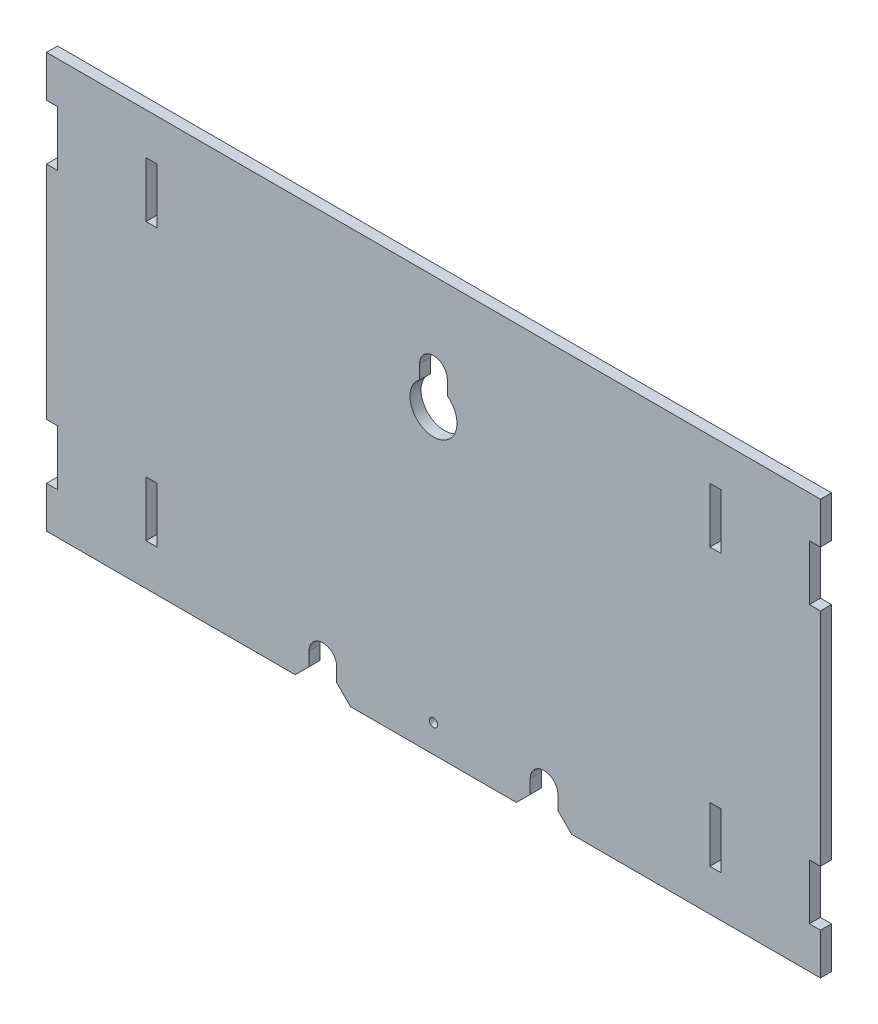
ISO-10303-21;
HEADER;
FILE_DESCRIPTION(('STEP AP214'),'2;1');
FILE_NAME('part.step','',(''),(''),'','','');
FILE_SCHEMA(('AUTOMOTIVE_DESIGN { 1 0 10303 214 1 1 1 1 }'));
ENDSEC;
DATA;
#1=APPLICATION_CONTEXT('core data for automotive mechanical design processes');
#2=APPLICATION_PROTOCOL_DEFINITION('international standard','automotive_design',2000,#1);
#3=PRODUCT_CONTEXT('',#1,'mechanical');
#4=PRODUCT('Part','Part','',(#3));
#5=PRODUCT_RELATED_PRODUCT_CATEGORY('part','',(#4));
#6=PRODUCT_DEFINITION_FORMATION('','',#4);
#7=PRODUCT_DEFINITION_CONTEXT('part definition',#1,'design');
#8=PRODUCT_DEFINITION('design','',#6,#7);
#9=PRODUCT_DEFINITION_SHAPE('','',#8);
#10=(LENGTH_UNIT() NAMED_UNIT(*) SI_UNIT(.MILLI.,.METRE.));
#11=(NAMED_UNIT(*) PLANE_ANGLE_UNIT() SI_UNIT($,.RADIAN.));
#12=(NAMED_UNIT(*) SI_UNIT($,.STERADIAN.) SOLID_ANGLE_UNIT());
#13=UNCERTAINTY_MEASURE_WITH_UNIT(LENGTH_MEASURE(1.E-05),#10,'distance_accuracy_value','');
#14=(GEOMETRIC_REPRESENTATION_CONTEXT(3) GLOBAL_UNCERTAINTY_ASSIGNED_CONTEXT((#13)) GLOBAL_UNIT_ASSIGNED_CONTEXT((#10,
#11,#12)) REPRESENTATION_CONTEXT('',''));
#15=CARTESIAN_POINT('',(0.,0.,0.));
#16=DIRECTION('',(0.,0.,1.));
#17=DIRECTION('',(1.,0.,0.));
#18=AXIS2_PLACEMENT_3D('',#15,#16,#17);
#19=CARTESIAN_POINT('',(-40.,10.,4.));
#20=DIRECTION('',(0.,0.,1.));
#21=DIRECTION('',(1.,0.,0.));
#22=AXIS2_PLACEMENT_3D('',#19,#20,#21);
#23=PLANE('',#22);
#24=DIRECTION('',(0.,1.,0.));
#25=VECTOR('',#24,1.);
#26=CARTESIAN_POINT('',(5.,114.873863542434,4.));
#27=LINE('',#26,#25);
#28=CARTESIAN_POINT('',(5.,114.873863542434,4.));
#29=VERTEX_POINT('',#28);
#30=CARTESIAN_POINT('',(5.,120.,4.));
#31=VERTEX_POINT('',#30);
#32=EDGE_CURVE('E422',#29,#31,#27,.T.);
#33=ORIENTED_EDGE('',*,*,#32,.F.);
#34=CARTESIAN_POINT('',(0.,108.,4.));
#35=DIRECTION('',(0.,0.,1.));
#36=DIRECTION('',(1.,0.,0.));
#37=AXIS2_PLACEMENT_3D('',#34,#35,#36);
#38=CIRCLE('',#37,8.5);
#39=CARTESIAN_POINT('',(-5.,114.873863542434,4.));
#40=VERTEX_POINT('',#39);
#41=EDGE_CURVE('E412',#40,#29,#38,.T.);
#42=ORIENTED_EDGE('',*,*,#41,.F.);
#43=DIRECTION('',(0.,-1.,0.));
#44=VECTOR('',#43,1.);
#45=CARTESIAN_POINT('',(-5.,114.873863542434,4.));
#46=LINE('',#45,#44);
#47=CARTESIAN_POINT('',(-5.,120.,4.));
#48=VERTEX_POINT('',#47);
#49=EDGE_CURVE('E442',#48,#40,#46,.T.);
#50=ORIENTED_EDGE('',*,*,#49,.F.);
#51=CARTESIAN_POINT('',(0.,120.,4.));
#52=DIRECTION('',(0.,0.,1.));
#53=DIRECTION('',(1.,0.,0.));
#54=AXIS2_PLACEMENT_3D('',#51,#52,#53);
#55=CIRCLE('',#54,5.);
#56=EDGE_CURVE('E436',#31,#48,#55,.T.);
#57=ORIENTED_EDGE('',*,*,#56,.F.);
#58=EDGE_LOOP('',(#33,#42,#50,#57));
#59=FACE_BOUND('',#58,.T.);
#60=DIRECTION('',(1.,0.,0.));
#61=VECTOR('',#60,1.);
#62=CARTESIAN_POINT('',(100.,115.,4.));
#63=LINE('',#62,#61);
#64=CARTESIAN_POINT('',(100.,115.,4.));
#65=VERTEX_POINT('',#64);
#66=CARTESIAN_POINT('',(104.,115.,4.));
#67=VERTEX_POINT('',#66);
#68=EDGE_CURVE('E497',#65,#67,#63,.T.);
#69=ORIENTED_EDGE('',*,*,#68,.F.);
#70=DIRECTION('',(0.,-1.,0.));
#71=VECTOR('',#70,1.);
#72=CARTESIAN_POINT('',(100.,135.,4.));
#73=LINE('',#72,#71);
#74=CARTESIAN_POINT('',(100.,135.,4.));
#75=VERTEX_POINT('',#74);
#76=EDGE_CURVE('E494',#75,#65,#73,.T.);
#77=ORIENTED_EDGE('',*,*,#76,.F.);
#78=DIRECTION('',(-1.,0.,0.));
#79=VECTOR('',#78,1.);
#80=CARTESIAN_POINT('',(100.,135.,4.));
#81=LINE('',#80,#79);
#82=CARTESIAN_POINT('',(104.,135.,4.));
#83=VERTEX_POINT('',#82);
#84=EDGE_CURVE('E505',#83,#75,#81,.T.);
#85=ORIENTED_EDGE('',*,*,#84,.F.);
#86=DIRECTION('',(0.,1.,0.));
#87=VECTOR('',#86,1.);
#88=CARTESIAN_POINT('',(104.,135.,4.));
#89=LINE('',#88,#87);
#90=EDGE_CURVE('E501',#67,#83,#89,.T.);
#91=ORIENTED_EDGE('',*,*,#90,.F.);
#92=EDGE_LOOP('',(#69,#77,#85,#91));
#93=FACE_BOUND('',#92,.T.);
#94=DIRECTION('',(1.,0.,0.));
#95=VECTOR('',#94,1.);
#96=CARTESIAN_POINT('',(-104.,115.,4.));
#97=LINE('',#96,#95);
#98=CARTESIAN_POINT('',(-104.,115.,4.));
#99=VERTEX_POINT('',#98);
#100=CARTESIAN_POINT('',(-100.,115.,4.));
#101=VERTEX_POINT('',#100);
#102=EDGE_CURVE('E569',#99,#101,#97,.T.);
#103=ORIENTED_EDGE('',*,*,#102,.F.);
#104=DIRECTION('',(0.,-1.,0.));
#105=VECTOR('',#104,1.);
#106=CARTESIAN_POINT('',(-104.,135.,4.));
#107=LINE('',#106,#105);
#108=CARTESIAN_POINT('',(-104.,135.,4.));
#109=VERTEX_POINT('',#108);
#110=EDGE_CURVE('E567',#109,#99,#107,.T.);
#111=ORIENTED_EDGE('',*,*,#110,.F.);
#112=DIRECTION('',(-1.,0.,0.));
#113=VECTOR('',#112,1.);
#114=CARTESIAN_POINT('',(-104.,135.,4.));
#115=LINE('',#114,#113);
#116=CARTESIAN_POINT('',(-100.,135.,4.));
#117=VERTEX_POINT('',#116);
#118=EDGE_CURVE('E575',#117,#109,#115,.T.);
#119=ORIENTED_EDGE('',*,*,#118,.F.);
#120=DIRECTION('',(0.,1.,0.));
#121=VECTOR('',#120,1.);
#122=CARTESIAN_POINT('',(-100.,135.,4.));
#123=LINE('',#122,#121);
#124=EDGE_CURVE('E572',#101,#117,#123,.T.);
#125=ORIENTED_EDGE('',*,*,#124,.F.);
#126=EDGE_LOOP('',(#103,#111,#119,#125));
#127=FACE_BOUND('',#126,.T.);
#128=DIRECTION('',(0.,-1.,0.));
#129=VECTOR('',#128,1.);
#130=CARTESIAN_POINT('',(45.,0.,4.));
#131=LINE('',#130,#129);
#132=CARTESIAN_POINT('',(45.,10.,4.));
#133=VERTEX_POINT('',#132);
#134=CARTESIAN_POINT('',(45.,5.,4.));
#135=VERTEX_POINT('',#134);
#136=EDGE_CURVE('E637',#133,#135,#131,.T.);
#137=ORIENTED_EDGE('',*,*,#136,.T.);
#138=DIRECTION('',(-0.707106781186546,0.707106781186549,0.));
#139=VECTOR('',#138,1.);
#140=CARTESIAN_POINT('',(2.08166817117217E-13,50.,4.));
#141=LINE('',#140,#139);
#142=CARTESIAN_POINT('',(50.,0.,4.));
#143=VERTEX_POINT('',#142);
#144=EDGE_CURVE('E854',#135,#143,#141,.F.);
#145=ORIENTED_EDGE('',*,*,#144,.T.);
#146=DIRECTION('',(1.,0.,0.));
#147=VECTOR('',#146,1.);
#148=CARTESIAN_POINT('',(45.,0.,4.));
#149=LINE('',#148,#147);
#150=CARTESIAN_POINT('',(140.,0.,4.));
#151=VERTEX_POINT('',#150);
#152=EDGE_CURVE('E641',#143,#151,#149,.T.);
#153=ORIENTED_EDGE('',*,*,#152,.T.);
#154=DIRECTION('',(0.,1.,0.));
#155=VECTOR('',#154,1.);
#156=CARTESIAN_POINT('',(140.,15.,4.));
#157=LINE('',#156,#155);
#158=CARTESIAN_POINT('',(140.,15.,4.));
#159=VERTEX_POINT('',#158);
#160=EDGE_CURVE('E644',#151,#159,#157,.T.);
#161=ORIENTED_EDGE('',*,*,#160,.T.);
#162=DIRECTION('',(-1.,0.,0.));
#163=VECTOR('',#162,1.);
#164=CARTESIAN_POINT('',(140.,15.,4.));
#165=LINE('',#164,#163);
#166=CARTESIAN_POINT('',(136.,15.,4.));
#167=VERTEX_POINT('',#166);
#168=EDGE_CURVE('E647',#159,#167,#165,.T.);
#169=ORIENTED_EDGE('',*,*,#168,.T.);
#170=DIRECTION('',(0.,1.,0.));
#171=VECTOR('',#170,1.);
#172=CARTESIAN_POINT('',(136.,35.,4.));
#173=LINE('',#172,#171);
#174=CARTESIAN_POINT('',(136.,35.,4.));
#175=VERTEX_POINT('',#174);
#176=EDGE_CURVE('E650',#167,#175,#173,.T.);
#177=ORIENTED_EDGE('',*,*,#176,.T.);
#178=DIRECTION('',(1.,0.,0.));
#179=VECTOR('',#178,1.);
#180=CARTESIAN_POINT('',(140.,35.,4.));
#181=LINE('',#180,#179);
#182=CARTESIAN_POINT('',(140.,35.,4.));
#183=VERTEX_POINT('',#182);
#184=EDGE_CURVE('E653',#175,#183,#181,.T.);
#185=ORIENTED_EDGE('',*,*,#184,.T.);
#186=DIRECTION('',(0.,1.,0.));
#187=VECTOR('',#186,1.);
#188=CARTESIAN_POINT('',(140.,115.,4.));
#189=LINE('',#188,#187);
#190=CARTESIAN_POINT('',(140.,115.,4.));
#191=VERTEX_POINT('',#190);
#192=EDGE_CURVE('E656',#183,#191,#189,.T.);
#193=ORIENTED_EDGE('',*,*,#192,.T.);
#194=DIRECTION('',(-1.,0.,0.));
#195=VECTOR('',#194,1.);
#196=CARTESIAN_POINT('',(140.,115.,4.));
#197=LINE('',#196,#195);
#198=CARTESIAN_POINT('',(136.,115.,4.));
#199=VERTEX_POINT('',#198);
#200=EDGE_CURVE('E659',#191,#199,#197,.T.);
#201=ORIENTED_EDGE('',*,*,#200,.T.);
#202=DIRECTION('',(0.,1.,0.));
#203=VECTOR('',#202,1.);
#204=CARTESIAN_POINT('',(136.,135.,4.));
#205=LINE('',#204,#203);
#206=CARTESIAN_POINT('',(136.,135.,4.));
#207=VERTEX_POINT('',#206);
#208=EDGE_CURVE('E662',#199,#207,#205,.T.);
#209=ORIENTED_EDGE('',*,*,#208,.T.);
#210=DIRECTION('',(1.,0.,0.));
#211=VECTOR('',#210,1.);
#212=CARTESIAN_POINT('',(140.,135.,4.));
#213=LINE('',#212,#211);
#214=CARTESIAN_POINT('',(140.,135.,4.));
#215=VERTEX_POINT('',#214);
#216=EDGE_CURVE('E665',#207,#215,#213,.T.);
#217=ORIENTED_EDGE('',*,*,#216,.T.);
#218=DIRECTION('',(0.,1.,0.));
#219=VECTOR('',#218,1.);
#220=CARTESIAN_POINT('',(140.,150.,4.));
#221=LINE('',#220,#219);
#222=CARTESIAN_POINT('',(140.,150.,4.));
#223=VERTEX_POINT('',#222);
#224=EDGE_CURVE('E668',#215,#223,#221,.T.);
#225=ORIENTED_EDGE('',*,*,#224,.T.);
#226=DIRECTION('',(-1.,0.,0.));
#227=VECTOR('',#226,1.);
#228=CARTESIAN_POINT('',(-140.,150.,4.));
#229=LINE('',#228,#227);
#230=CARTESIAN_POINT('',(-140.,150.,4.));
#231=VERTEX_POINT('',#230);
#232=EDGE_CURVE('E671',#223,#231,#229,.T.);
#233=ORIENTED_EDGE('',*,*,#232,.T.);
#234=DIRECTION('',(0.,-1.,0.));
#235=VECTOR('',#234,1.);
#236=CARTESIAN_POINT('',(-140.,150.,4.));
#237=LINE('',#236,#235);
#238=CARTESIAN_POINT('',(-140.,135.,4.));
#239=VERTEX_POINT('',#238);
#240=EDGE_CURVE('E598',#231,#239,#237,.T.);
#241=ORIENTED_EDGE('',*,*,#240,.T.);
#242=DIRECTION('',(1.,0.,0.));
#243=VECTOR('',#242,1.);
#244=CARTESIAN_POINT('',(-140.,135.,4.));
#245=LINE('',#244,#243);
#246=CARTESIAN_POINT('',(-136.,135.,4.));
#247=VERTEX_POINT('',#246);
#248=EDGE_CURVE('E601',#239,#247,#245,.T.);
#249=ORIENTED_EDGE('',*,*,#248,.T.);
#250=DIRECTION('',(0.,-1.,0.));
#251=VECTOR('',#250,1.);
#252=CARTESIAN_POINT('',(-136.,135.,4.));
#253=LINE('',#252,#251);
#254=CARTESIAN_POINT('',(-136.,115.,4.));
#255=VERTEX_POINT('',#254);
#256=EDGE_CURVE('E604',#247,#255,#253,.T.);
#257=ORIENTED_EDGE('',*,*,#256,.T.);
#258=DIRECTION('',(-1.,0.,0.));
#259=VECTOR('',#258,1.);
#260=CARTESIAN_POINT('',(-140.,115.,4.));
#261=LINE('',#260,#259);
#262=CARTESIAN_POINT('',(-140.,115.,4.));
#263=VERTEX_POINT('',#262);
#264=EDGE_CURVE('E606',#255,#263,#261,.T.);
#265=ORIENTED_EDGE('',*,*,#264,.T.);
#266=DIRECTION('',(0.,-1.,0.));
#267=VECTOR('',#266,1.);
#268=CARTESIAN_POINT('',(-140.,115.,4.));
#269=LINE('',#268,#267);
#270=CARTESIAN_POINT('',(-140.,35.,4.));
#271=VERTEX_POINT('',#270);
#272=EDGE_CURVE('E608',#263,#271,#269,.T.);
#273=ORIENTED_EDGE('',*,*,#272,.T.);
#274=DIRECTION('',(1.,0.,0.));
#275=VECTOR('',#274,1.);
#276=CARTESIAN_POINT('',(-140.,35.,4.));
#277=LINE('',#276,#275);
#278=CARTESIAN_POINT('',(-136.,35.,4.));
#279=VERTEX_POINT('',#278);
#280=EDGE_CURVE('E610',#271,#279,#277,.T.);
#281=ORIENTED_EDGE('',*,*,#280,.T.);
#282=DIRECTION('',(0.,-1.,0.));
#283=VECTOR('',#282,1.);
#284=CARTESIAN_POINT('',(-136.,35.,4.));
#285=LINE('',#284,#283);
#286=CARTESIAN_POINT('',(-136.,15.,4.));
#287=VERTEX_POINT('',#286);
#288=EDGE_CURVE('E612',#279,#287,#285,.T.);
#289=ORIENTED_EDGE('',*,*,#288,.T.);
#290=DIRECTION('',(-1.,0.,0.));
#291=VECTOR('',#290,1.);
#292=CARTESIAN_POINT('',(-140.,15.,4.));
#293=LINE('',#292,#291);
#294=CARTESIAN_POINT('',(-140.,15.,4.));
#295=VERTEX_POINT('',#294);
#296=EDGE_CURVE('E614',#287,#295,#293,.T.);
#297=ORIENTED_EDGE('',*,*,#296,.T.);
#298=DIRECTION('',(0.,-1.,0.));
#299=VECTOR('',#298,1.);
#300=CARTESIAN_POINT('',(-140.,15.,4.));
#301=LINE('',#300,#299);
#302=CARTESIAN_POINT('',(-140.,0.,4.));
#303=VERTEX_POINT('',#302);
#304=EDGE_CURVE('E616',#295,#303,#301,.T.);
#305=ORIENTED_EDGE('',*,*,#304,.T.);
#306=DIRECTION('',(1.,0.,0.));
#307=VECTOR('',#306,1.);
#308=CARTESIAN_POINT('',(-140.,0.,4.));
#309=LINE('',#308,#307);
#310=CARTESIAN_POINT('',(-50.,0.,4.));
#311=VERTEX_POINT('',#310);
#312=EDGE_CURVE('E618',#303,#311,#309,.T.);
#313=ORIENTED_EDGE('',*,*,#312,.T.);
#314=DIRECTION('',(-0.707106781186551,-0.707106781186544,0.));
#315=VECTOR('',#314,1.);
#316=CARTESIAN_POINT('',(-39.9999999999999,9.99999999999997,4.));
#317=LINE('',#316,#315);
#318=CARTESIAN_POINT('',(-45.,4.99999999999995,4.));
#319=VERTEX_POINT('',#318);
#320=EDGE_CURVE('E848',#311,#319,#317,.F.);
#321=ORIENTED_EDGE('',*,*,#320,.T.);
#322=DIRECTION('',(0.,1.,0.));
#323=VECTOR('',#322,1.);
#324=CARTESIAN_POINT('',(-45.,0.,4.));
#325=LINE('',#324,#323);
#326=CARTESIAN_POINT('',(-45.,10.,4.));
#327=VERTEX_POINT('',#326);
#328=EDGE_CURVE('E621',#319,#327,#325,.T.);
#329=ORIENTED_EDGE('',*,*,#328,.T.);
#330=CARTESIAN_POINT('',(-40.,10.,4.));
#331=DIRECTION('',(0.,0.,-1.));
#332=DIRECTION('',(1.,0.,0.));
#333=AXIS2_PLACEMENT_3D('',#330,#331,#332);
#334=CIRCLE('',#333,5.);
#335=CARTESIAN_POINT('',(-35.,10.,4.));
#336=VERTEX_POINT('',#335);
#337=EDGE_CURVE('E623',#327,#336,#334,.T.);
#338=ORIENTED_EDGE('',*,*,#337,.T.);
#339=DIRECTION('',(0.,-1.,0.));
#340=VECTOR('',#339,1.);
#341=CARTESIAN_POINT('',(-35.,0.,4.));
#342=LINE('',#341,#340);
#343=CARTESIAN_POINT('',(-35.,5.00000000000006,4.));
#344=VERTEX_POINT('',#343);
#345=EDGE_CURVE('E625',#336,#344,#342,.T.);
#346=ORIENTED_EDGE('',*,*,#345,.T.);
#347=DIRECTION('',(-0.707106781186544,0.707106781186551,0.));
#348=VECTOR('',#347,1.);
#349=CARTESIAN_POINT('',(-40.,10.0000000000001,4.));
#350=LINE('',#349,#348);
#351=CARTESIAN_POINT('',(-30.,0.,4.));
#352=VERTEX_POINT('',#351);
#353=EDGE_CURVE('E850',#344,#352,#350,.F.);
#354=ORIENTED_EDGE('',*,*,#353,.T.);
#355=DIRECTION('',(1.,0.,0.));
#356=VECTOR('',#355,1.);
#357=CARTESIAN_POINT('',(-35.,0.,4.));
#358=LINE('',#357,#356);
#359=CARTESIAN_POINT('',(30.,0.,4.));
#360=VERTEX_POINT('',#359);
#361=EDGE_CURVE('E628',#352,#360,#358,.T.);
#362=ORIENTED_EDGE('',*,*,#361,.T.);
#363=DIRECTION('',(-0.707106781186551,-0.707106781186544,0.));
#364=VECTOR('',#363,1.);
#365=CARTESIAN_POINT('',(-3.67761376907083E-13,-30.,4.));
#366=LINE('',#365,#364);
#367=CARTESIAN_POINT('',(35.,4.99999999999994,4.));
#368=VERTEX_POINT('',#367);
#369=EDGE_CURVE('E57',#360,#368,#366,.F.);
#370=ORIENTED_EDGE('',*,*,#369,.T.);
#371=DIRECTION('',(0.,1.,0.));
#372=VECTOR('',#371,1.);
#373=CARTESIAN_POINT('',(35.,0.,4.));
#374=LINE('',#373,#372);
#375=CARTESIAN_POINT('',(35.,10.,4.));
#376=VERTEX_POINT('',#375);
#377=EDGE_CURVE('E631',#368,#376,#374,.T.);
#378=ORIENTED_EDGE('',*,*,#377,.T.);
#379=CARTESIAN_POINT('',(40.,10.,4.));
#380=DIRECTION('',(0.,0.,-1.));
#381=DIRECTION('',(1.,0.,0.));
#382=AXIS2_PLACEMENT_3D('',#379,#380,#381);
#383=CIRCLE('',#382,5.);
#384=EDGE_CURVE('E634',#376,#133,#383,.T.);
#385=ORIENTED_EDGE('',*,*,#384,.T.);
#386=EDGE_LOOP('',(#137,#145,#153,#161,#169,#177,#185,#193,#201,#209,#217,#225,#233,#241,#249,
#257,#265,#273,#281,#289,#297,#305,#313,#321,#329,#338,#346,#354,#362,#370,#378,#385));
#387=FACE_BOUND('',#386,.T.);
#388=DIRECTION('',(0.,1.,0.));
#389=VECTOR('',#388,1.);
#390=CARTESIAN_POINT('',(-100.,35.,4.));
#391=LINE('',#390,#389);
#392=CARTESIAN_POINT('',(-100.,15.,4.));
#393=VERTEX_POINT('',#392);
#394=CARTESIAN_POINT('',(-100.,35.,4.));
#395=VERTEX_POINT('',#394);
#396=EDGE_CURVE('E538',#393,#395,#391,.T.);
#397=ORIENTED_EDGE('',*,*,#396,.F.);
#398=DIRECTION('',(1.,0.,0.));
#399=VECTOR('',#398,1.);
#400=CARTESIAN_POINT('',(-104.,15.,4.));
#401=LINE('',#400,#399);
#402=CARTESIAN_POINT('',(-104.,15.,4.));
#403=VERTEX_POINT('',#402);
#404=EDGE_CURVE('E536',#403,#393,#401,.T.);
#405=ORIENTED_EDGE('',*,*,#404,.F.);
#406=DIRECTION('',(0.,-1.,0.));
#407=VECTOR('',#406,1.);
#408=CARTESIAN_POINT('',(-104.,35.,4.));
#409=LINE('',#408,#407);
#410=CARTESIAN_POINT('',(-104.,35.,4.));
#411=VERTEX_POINT('',#410);
#412=EDGE_CURVE('E544',#411,#403,#409,.T.);
#413=ORIENTED_EDGE('',*,*,#412,.F.);
#414=DIRECTION('',(-1.,0.,0.));
#415=VECTOR('',#414,1.);
#416=CARTESIAN_POINT('',(-104.,35.,4.));
#417=LINE('',#416,#415);
#418=EDGE_CURVE('E541',#395,#411,#417,.T.);
#419=ORIENTED_EDGE('',*,*,#418,.F.);
#420=EDGE_LOOP('',(#397,#405,#413,#419));
#421=FACE_BOUND('',#420,.T.);
#422=DIRECTION('',(-1.,0.,0.));
#423=VECTOR('',#422,1.);
#424=CARTESIAN_POINT('',(100.,35.,4.));
#425=LINE('',#424,#423);
#426=CARTESIAN_POINT('',(104.,35.,4.));
#427=VERTEX_POINT('',#426);
#428=CARTESIAN_POINT('',(100.,35.,4.));
#429=VERTEX_POINT('',#428);
#430=EDGE_CURVE('E462',#427,#429,#425,.T.);
#431=ORIENTED_EDGE('',*,*,#430,.F.);
#432=DIRECTION('',(0.,1.,0.));
#433=VECTOR('',#432,1.);
#434=CARTESIAN_POINT('',(104.,35.,4.));
#435=LINE('',#434,#433);
#436=CARTESIAN_POINT('',(104.,15.,4.));
#437=VERTEX_POINT('',#436);
#438=EDGE_CURVE('E460',#437,#427,#435,.T.);
#439=ORIENTED_EDGE('',*,*,#438,.F.);
#440=DIRECTION('',(1.,0.,0.));
#441=VECTOR('',#440,1.);
#442=CARTESIAN_POINT('',(100.,15.,4.));
#443=LINE('',#442,#441);
#444=CARTESIAN_POINT('',(100.,15.,4.));
#445=VERTEX_POINT('',#444);
#446=EDGE_CURVE('E468',#445,#437,#443,.T.);
#447=ORIENTED_EDGE('',*,*,#446,.F.);
#448=DIRECTION('',(0.,-1.,0.));
#449=VECTOR('',#448,1.);
#450=CARTESIAN_POINT('',(100.,35.,4.));
#451=LINE('',#450,#449);
#452=EDGE_CURVE('E465',#429,#445,#451,.T.);
#453=ORIENTED_EDGE('',*,*,#452,.F.);
#454=EDGE_LOOP('',(#431,#439,#447,#453));
#455=FACE_BOUND('',#454,.T.);
#456=CARTESIAN_POINT('',(0.,10.,4.));
#457=DIRECTION('',(0.,0.,1.));
#458=DIRECTION('',(1.,0.,0.));
#459=AXIS2_PLACEMENT_3D('',#456,#457,#458);
#460=CIRCLE('',#459,1.5);
#461=CARTESIAN_POINT('',(1.5,10.,4.));
#462=VERTEX_POINT('',#461);
#463=EDGE_CURVE('E449',#462,#462,#460,.T.);
#464=ORIENTED_EDGE('',*,*,#463,.F.);
#465=EDGE_LOOP('',(#464));
#466=FACE_BOUND('',#465,.T.);
#467=ADVANCED_FACE('F39',(#59,#93,#127,#387,#421,#455,#466),#23,.T.);
#468=CARTESIAN_POINT('',(-40.,10.,0.));
#469=DIRECTION('',(0.,0.,1.));
#470=DIRECTION('',(1.,0.,0.));
#471=AXIS2_PLACEMENT_3D('',#468,#469,#470);
#472=PLANE('',#471);
#473=CARTESIAN_POINT('',(0.,108.,0.));
#474=DIRECTION('',(0.,0.,1.));
#475=DIRECTION('',(1.,0.,0.));
#476=AXIS2_PLACEMENT_3D('',#473,#474,#475);
#477=CIRCLE('',#476,8.5);
#478=CARTESIAN_POINT('',(-5.,114.873863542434,0.));
#479=VERTEX_POINT('',#478);
#480=CARTESIAN_POINT('',(5.,114.873863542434,0.));
#481=VERTEX_POINT('',#480);
#482=EDGE_CURVE('E447',#479,#481,#477,.T.);
#483=ORIENTED_EDGE('',*,*,#482,.T.);
#484=DIRECTION('',(0.,1.,0.));
#485=VECTOR('',#484,1.);
#486=CARTESIAN_POINT('',(5.,114.873863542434,0.));
#487=LINE('',#486,#485);
#488=CARTESIAN_POINT('',(5.,120.,0.));
#489=VERTEX_POINT('',#488);
#490=EDGE_CURVE('E429',#481,#489,#487,.T.);
#491=ORIENTED_EDGE('',*,*,#490,.T.);
#492=CARTESIAN_POINT('',(0.,120.,0.));
#493=DIRECTION('',(0.,0.,1.));
#494=DIRECTION('',(1.,0.,0.));
#495=AXIS2_PLACEMENT_3D('',#492,#493,#494);
#496=CIRCLE('',#495,5.);
#497=CARTESIAN_POINT('',(-5.,120.,0.));
#498=VERTEX_POINT('',#497);
#499=EDGE_CURVE('E451',#489,#498,#496,.T.);
#500=ORIENTED_EDGE('',*,*,#499,.T.);
#501=DIRECTION('',(0.,-1.,0.));
#502=VECTOR('',#501,1.);
#503=CARTESIAN_POINT('',(-5.,114.873863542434,0.));
#504=LINE('',#503,#502);
#505=EDGE_CURVE('E423',#498,#479,#504,.T.);
#506=ORIENTED_EDGE('',*,*,#505,.T.);
#507=EDGE_LOOP('',(#483,#491,#500,#506));
#508=FACE_BOUND('',#507,.T.);
#509=DIRECTION('',(0.,-1.,0.));
#510=VECTOR('',#509,1.);
#511=CARTESIAN_POINT('',(100.,135.,0.));
#512=LINE('',#511,#510);
#513=CARTESIAN_POINT('',(100.,135.,0.));
#514=VERTEX_POINT('',#513);
#515=CARTESIAN_POINT('',(100.,115.,0.));
#516=VERTEX_POINT('',#515);
#517=EDGE_CURVE('E493',#514,#516,#512,.T.);
#518=ORIENTED_EDGE('',*,*,#517,.T.);
#519=DIRECTION('',(1.,0.,0.));
#520=VECTOR('',#519,1.);
#521=CARTESIAN_POINT('',(100.,115.,0.));
#522=LINE('',#521,#520);
#523=CARTESIAN_POINT('',(104.,115.,0.));
#524=VERTEX_POINT('',#523);
#525=EDGE_CURVE('E512',#516,#524,#522,.T.);
#526=ORIENTED_EDGE('',*,*,#525,.T.);
#527=DIRECTION('',(0.,1.,0.));
#528=VECTOR('',#527,1.);
#529=CARTESIAN_POINT('',(104.,135.,0.));
#530=LINE('',#529,#528);
#531=CARTESIAN_POINT('',(104.,135.,0.));
#532=VERTEX_POINT('',#531);
#533=EDGE_CURVE('E516',#524,#532,#530,.T.);
#534=ORIENTED_EDGE('',*,*,#533,.T.);
#535=DIRECTION('',(-1.,0.,0.));
#536=VECTOR('',#535,1.);
#537=CARTESIAN_POINT('',(100.,135.,0.));
#538=LINE('',#537,#536);
#539=EDGE_CURVE('E498',#532,#514,#538,.T.);
#540=ORIENTED_EDGE('',*,*,#539,.T.);
#541=EDGE_LOOP('',(#518,#526,#534,#540));
#542=FACE_BOUND('',#541,.T.);
#543=DIRECTION('',(0.,-1.,0.));
#544=VECTOR('',#543,1.);
#545=CARTESIAN_POINT('',(-104.,135.,0.));
#546=LINE('',#545,#544);
#547=CARTESIAN_POINT('',(-104.,135.,0.));
#548=VERTEX_POINT('',#547);
#549=CARTESIAN_POINT('',(-104.,115.,0.));
#550=VERTEX_POINT('',#549);
#551=EDGE_CURVE('E566',#548,#550,#546,.T.);
#552=ORIENTED_EDGE('',*,*,#551,.T.);
#553=DIRECTION('',(1.,0.,0.));
#554=VECTOR('',#553,1.);
#555=CARTESIAN_POINT('',(-104.,115.,0.));
#556=LINE('',#555,#554);
#557=CARTESIAN_POINT('',(-100.,115.,0.));
#558=VERTEX_POINT('',#557);
#559=EDGE_CURVE('E580',#550,#558,#556,.T.);
#560=ORIENTED_EDGE('',*,*,#559,.T.);
#561=DIRECTION('',(0.,1.,0.));
#562=VECTOR('',#561,1.);
#563=CARTESIAN_POINT('',(-100.,135.,0.));
#564=LINE('',#563,#562);
#565=CARTESIAN_POINT('',(-100.,135.,0.));
#566=VERTEX_POINT('',#565);
#567=EDGE_CURVE('E583',#558,#566,#564,.T.);
#568=ORIENTED_EDGE('',*,*,#567,.T.);
#569=DIRECTION('',(-1.,0.,0.));
#570=VECTOR('',#569,1.);
#571=CARTESIAN_POINT('',(-104.,135.,0.));
#572=LINE('',#571,#570);
#573=EDGE_CURVE('E570',#566,#548,#572,.T.);
#574=ORIENTED_EDGE('',*,*,#573,.T.);
#575=EDGE_LOOP('',(#552,#560,#568,#574));
#576=FACE_BOUND('',#575,.T.);
#577=DIRECTION('',(1.,0.,0.));
#578=VECTOR('',#577,1.);
#579=CARTESIAN_POINT('',(45.,0.,0.));
#580=LINE('',#579,#578);
#581=CARTESIAN_POINT('',(50.,0.,0.));
#582=VERTEX_POINT('',#581);
#583=CARTESIAN_POINT('',(140.,0.,0.));
#584=VERTEX_POINT('',#583);
#585=EDGE_CURVE('E716',#582,#584,#580,.T.);
#586=ORIENTED_EDGE('',*,*,#585,.F.);
#587=DIRECTION('',(0.707106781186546,-0.707106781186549,0.));
#588=VECTOR('',#587,1.);
#589=CARTESIAN_POINT('',(50.,0.,0.));
#590=LINE('',#589,#588);
#591=CARTESIAN_POINT('',(45.,5.,0.));
#592=VERTEX_POINT('',#591);
#593=EDGE_CURVE('E842',#582,#592,#590,.F.);
#594=ORIENTED_EDGE('',*,*,#593,.T.);
#595=DIRECTION('',(0.,-1.,0.));
#596=VECTOR('',#595,1.);
#597=CARTESIAN_POINT('',(45.,0.,0.));
#598=LINE('',#597,#596);
#599=CARTESIAN_POINT('',(45.,10.,0.));
#600=VERTEX_POINT('',#599);
#601=EDGE_CURVE('E712',#600,#592,#598,.T.);
#602=ORIENTED_EDGE('',*,*,#601,.F.);
#603=CARTESIAN_POINT('',(40.,10.,0.));
#604=DIRECTION('',(0.,0.,-1.));
#605=DIRECTION('',(1.,0.,0.));
#606=AXIS2_PLACEMENT_3D('',#603,#604,#605);
#607=CIRCLE('',#606,5.);
#608=CARTESIAN_POINT('',(35.,10.,0.));
#609=VERTEX_POINT('',#608);
#610=EDGE_CURVE('E709',#609,#600,#607,.T.);
#611=ORIENTED_EDGE('',*,*,#610,.F.);
#612=DIRECTION('',(0.,1.,0.));
#613=VECTOR('',#612,1.);
#614=CARTESIAN_POINT('',(35.,0.,0.));
#615=LINE('',#614,#613);
#616=CARTESIAN_POINT('',(35.,4.99999999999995,0.));
#617=VERTEX_POINT('',#616);
#618=EDGE_CURVE('E706',#617,#609,#615,.T.);
#619=ORIENTED_EDGE('',*,*,#618,.F.);
#620=DIRECTION('',(0.707106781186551,0.707106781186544,0.));
#621=VECTOR('',#620,1.);
#622=CARTESIAN_POINT('',(35.,4.99999999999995,0.));
#623=LINE('',#622,#621);
#624=CARTESIAN_POINT('',(30.,0.,0.));
#625=VERTEX_POINT('',#624);
#626=EDGE_CURVE('E839',#617,#625,#623,.F.);
#627=ORIENTED_EDGE('',*,*,#626,.T.);
#628=DIRECTION('',(1.,0.,0.));
#629=VECTOR('',#628,1.);
#630=CARTESIAN_POINT('',(-35.,0.,0.));
#631=LINE('',#630,#629);
#632=CARTESIAN_POINT('',(-30.,0.,0.));
#633=VERTEX_POINT('',#632);
#634=EDGE_CURVE('E703',#633,#625,#631,.T.);
#635=ORIENTED_EDGE('',*,*,#634,.F.);
#636=DIRECTION('',(0.707106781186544,-0.707106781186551,0.));
#637=VECTOR('',#636,1.);
#638=CARTESIAN_POINT('',(-30.,0.,0.));
#639=LINE('',#638,#637);
#640=CARTESIAN_POINT('',(-35.,5.00000000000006,0.));
#641=VERTEX_POINT('',#640);
#642=EDGE_CURVE('E837',#633,#641,#639,.F.);
#643=ORIENTED_EDGE('',*,*,#642,.T.);
#644=DIRECTION('',(0.,-1.,0.));
#645=VECTOR('',#644,1.);
#646=CARTESIAN_POINT('',(-35.,0.,0.));
#647=LINE('',#646,#645);
#648=CARTESIAN_POINT('',(-35.,10.,0.));
#649=VERTEX_POINT('',#648);
#650=EDGE_CURVE('E700',#649,#641,#647,.T.);
#651=ORIENTED_EDGE('',*,*,#650,.F.);
#652=CARTESIAN_POINT('',(-40.,10.,0.));
#653=DIRECTION('',(0.,0.,-1.));
#654=DIRECTION('',(1.,0.,0.));
#655=AXIS2_PLACEMENT_3D('',#652,#653,#654);
#656=CIRCLE('',#655,5.);
#657=CARTESIAN_POINT('',(-45.,10.,0.));
#658=VERTEX_POINT('',#657);
#659=EDGE_CURVE('E698',#658,#649,#656,.T.);
#660=ORIENTED_EDGE('',*,*,#659,.F.);
#661=DIRECTION('',(0.,1.,0.));
#662=VECTOR('',#661,1.);
#663=CARTESIAN_POINT('',(-45.,0.,0.));
#664=LINE('',#663,#662);
#665=CARTESIAN_POINT('',(-45.,4.99999999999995,0.));
#666=VERTEX_POINT('',#665);
#667=EDGE_CURVE('E696',#666,#658,#664,.T.);
#668=ORIENTED_EDGE('',*,*,#667,.F.);
#669=DIRECTION('',(0.707106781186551,0.707106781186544,0.));
#670=VECTOR('',#669,1.);
#671=CARTESIAN_POINT('',(-45.,4.99999999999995,0.));
#672=LINE('',#671,#670);
#673=CARTESIAN_POINT('',(-50.,0.,0.));
#674=VERTEX_POINT('',#673);
#675=EDGE_CURVE('E835',#666,#674,#672,.F.);
#676=ORIENTED_EDGE('',*,*,#675,.T.);
#677=DIRECTION('',(1.,0.,0.));
#678=VECTOR('',#677,1.);
#679=CARTESIAN_POINT('',(-140.,0.,0.));
#680=LINE('',#679,#678);
#681=CARTESIAN_POINT('',(-140.,0.,0.));
#682=VERTEX_POINT('',#681);
#683=EDGE_CURVE('E693',#682,#674,#680,.T.);
#684=ORIENTED_EDGE('',*,*,#683,.F.);
#685=DIRECTION('',(0.,-1.,0.));
#686=VECTOR('',#685,1.);
#687=CARTESIAN_POINT('',(-140.,15.,0.));
#688=LINE('',#687,#686);
#689=CARTESIAN_POINT('',(-140.,15.,0.));
#690=VERTEX_POINT('',#689);
#691=EDGE_CURVE('E691',#690,#682,#688,.T.);
#692=ORIENTED_EDGE('',*,*,#691,.F.);
#693=DIRECTION('',(-1.,0.,0.));
#694=VECTOR('',#693,1.);
#695=CARTESIAN_POINT('',(-140.,15.,0.));
#696=LINE('',#695,#694);
#697=CARTESIAN_POINT('',(-136.,15.,0.));
#698=VERTEX_POINT('',#697);
#699=EDGE_CURVE('E689',#698,#690,#696,.T.);
#700=ORIENTED_EDGE('',*,*,#699,.F.);
#701=DIRECTION('',(0.,-1.,0.));
#702=VECTOR('',#701,1.);
#703=CARTESIAN_POINT('',(-136.,35.,0.));
#704=LINE('',#703,#702);
#705=CARTESIAN_POINT('',(-136.,35.,0.));
#706=VERTEX_POINT('',#705);
#707=EDGE_CURVE('E687',#706,#698,#704,.T.);
#708=ORIENTED_EDGE('',*,*,#707,.F.);
#709=DIRECTION('',(1.,0.,0.));
#710=VECTOR('',#709,1.);
#711=CARTESIAN_POINT('',(-140.,35.,0.));
#712=LINE('',#711,#710);
#713=CARTESIAN_POINT('',(-140.,35.,0.));
#714=VERTEX_POINT('',#713);
#715=EDGE_CURVE('E685',#714,#706,#712,.T.);
#716=ORIENTED_EDGE('',*,*,#715,.F.);
#717=DIRECTION('',(0.,-1.,0.));
#718=VECTOR('',#717,1.);
#719=CARTESIAN_POINT('',(-140.,115.,0.));
#720=LINE('',#719,#718);
#721=CARTESIAN_POINT('',(-140.,115.,0.));
#722=VERTEX_POINT('',#721);
#723=EDGE_CURVE('E683',#722,#714,#720,.T.);
#724=ORIENTED_EDGE('',*,*,#723,.F.);
#725=DIRECTION('',(-1.,0.,0.));
#726=VECTOR('',#725,1.);
#727=CARTESIAN_POINT('',(-140.,115.,0.));
#728=LINE('',#727,#726);
#729=CARTESIAN_POINT('',(-136.,115.,0.));
#730=VERTEX_POINT('',#729);
#731=EDGE_CURVE('E681',#730,#722,#728,.T.);
#732=ORIENTED_EDGE('',*,*,#731,.F.);
#733=DIRECTION('',(0.,-1.,0.));
#734=VECTOR('',#733,1.);
#735=CARTESIAN_POINT('',(-136.,135.,0.));
#736=LINE('',#735,#734);
#737=CARTESIAN_POINT('',(-136.,135.,0.));
#738=VERTEX_POINT('',#737);
#739=EDGE_CURVE('E679',#738,#730,#736,.T.);
#740=ORIENTED_EDGE('',*,*,#739,.F.);
#741=DIRECTION('',(1.,0.,0.));
#742=VECTOR('',#741,1.);
#743=CARTESIAN_POINT('',(-140.,135.,0.));
#744=LINE('',#743,#742);
#745=CARTESIAN_POINT('',(-140.,135.,0.));
#746=VERTEX_POINT('',#745);
#747=EDGE_CURVE('E677',#746,#738,#744,.T.);
#748=ORIENTED_EDGE('',*,*,#747,.F.);
#749=DIRECTION('',(0.,-1.,0.));
#750=VECTOR('',#749,1.);
#751=CARTESIAN_POINT('',(-140.,150.,0.));
#752=LINE('',#751,#750);
#753=CARTESIAN_POINT('',(-140.,150.,0.));
#754=VERTEX_POINT('',#753);
#755=EDGE_CURVE('E597',#754,#746,#752,.T.);
#756=ORIENTED_EDGE('',*,*,#755,.F.);
#757=DIRECTION('',(-1.,0.,0.));
#758=VECTOR('',#757,1.);
#759=CARTESIAN_POINT('',(-140.,150.,0.));
#760=LINE('',#759,#758);
#761=CARTESIAN_POINT('',(140.,150.,0.));
#762=VERTEX_POINT('',#761);
#763=EDGE_CURVE('E602',#762,#754,#760,.T.);
#764=ORIENTED_EDGE('',*,*,#763,.F.);
#765=DIRECTION('',(0.,1.,0.));
#766=VECTOR('',#765,1.);
#767=CARTESIAN_POINT('',(140.,150.,0.));
#768=LINE('',#767,#766);
#769=CARTESIAN_POINT('',(140.,135.,0.));
#770=VERTEX_POINT('',#769);
#771=EDGE_CURVE('E743',#770,#762,#768,.T.);
#772=ORIENTED_EDGE('',*,*,#771,.F.);
#773=DIRECTION('',(1.,0.,0.));
#774=VECTOR('',#773,1.);
#775=CARTESIAN_POINT('',(140.,135.,0.));
#776=LINE('',#775,#774);
#777=CARTESIAN_POINT('',(136.,135.,0.));
#778=VERTEX_POINT('',#777);
#779=EDGE_CURVE('E740',#778,#770,#776,.T.);
#780=ORIENTED_EDGE('',*,*,#779,.F.);
#781=DIRECTION('',(0.,1.,0.));
#782=VECTOR('',#781,1.);
#783=CARTESIAN_POINT('',(136.,135.,0.));
#784=LINE('',#783,#782);
#785=CARTESIAN_POINT('',(136.,115.,0.));
#786=VERTEX_POINT('',#785);
#787=EDGE_CURVE('E737',#786,#778,#784,.T.);
#788=ORIENTED_EDGE('',*,*,#787,.F.);
#789=DIRECTION('',(-1.,0.,0.));
#790=VECTOR('',#789,1.);
#791=CARTESIAN_POINT('',(140.,115.,0.));
#792=LINE('',#791,#790);
#793=CARTESIAN_POINT('',(140.,115.,0.));
#794=VERTEX_POINT('',#793);
#795=EDGE_CURVE('E734',#794,#786,#792,.T.);
#796=ORIENTED_EDGE('',*,*,#795,.F.);
#797=DIRECTION('',(0.,1.,0.));
#798=VECTOR('',#797,1.);
#799=CARTESIAN_POINT('',(140.,115.,0.));
#800=LINE('',#799,#798);
#801=CARTESIAN_POINT('',(140.,35.,0.));
#802=VERTEX_POINT('',#801);
#803=EDGE_CURVE('E731',#802,#794,#800,.T.);
#804=ORIENTED_EDGE('',*,*,#803,.F.);
#805=DIRECTION('',(1.,0.,0.));
#806=VECTOR('',#805,1.);
#807=CARTESIAN_POINT('',(140.,35.,0.));
#808=LINE('',#807,#806);
#809=CARTESIAN_POINT('',(136.,35.,0.));
#810=VERTEX_POINT('',#809);
#811=EDGE_CURVE('E728',#810,#802,#808,.T.);
#812=ORIENTED_EDGE('',*,*,#811,.F.);
#813=DIRECTION('',(0.,1.,0.));
#814=VECTOR('',#813,1.);
#815=CARTESIAN_POINT('',(136.,35.,0.));
#816=LINE('',#815,#814);
#817=CARTESIAN_POINT('',(136.,15.,0.));
#818=VERTEX_POINT('',#817);
#819=EDGE_CURVE('E725',#818,#810,#816,.T.);
#820=ORIENTED_EDGE('',*,*,#819,.F.);
#821=DIRECTION('',(-1.,0.,0.));
#822=VECTOR('',#821,1.);
#823=CARTESIAN_POINT('',(140.,15.,0.));
#824=LINE('',#823,#822);
#825=CARTESIAN_POINT('',(140.,15.,0.));
#826=VERTEX_POINT('',#825);
#827=EDGE_CURVE('E722',#826,#818,#824,.T.);
#828=ORIENTED_EDGE('',*,*,#827,.F.);
#829=DIRECTION('',(0.,1.,0.));
#830=VECTOR('',#829,1.);
#831=CARTESIAN_POINT('',(140.,15.,0.));
#832=LINE('',#831,#830);
#833=EDGE_CURVE('E719',#584,#826,#832,.T.);
#834=ORIENTED_EDGE('',*,*,#833,.F.);
#835=EDGE_LOOP('',(#586,#594,#602,#611,#619,#627,#635,#643,#651,#660,#668,#676,#684,#692,#700,
#708,#716,#724,#732,#740,#748,#756,#764,#772,#780,#788,#796,#804,#812,#820,#828,#834));
#836=FACE_BOUND('',#835,.T.);
#837=DIRECTION('',(1.,0.,0.));
#838=VECTOR('',#837,1.);
#839=CARTESIAN_POINT('',(-104.,15.,0.));
#840=LINE('',#839,#838);
#841=CARTESIAN_POINT('',(-104.,15.,0.));
#842=VERTEX_POINT('',#841);
#843=CARTESIAN_POINT('',(-100.,15.,0.));
#844=VERTEX_POINT('',#843);
#845=EDGE_CURVE('E535',#842,#844,#840,.T.);
#846=ORIENTED_EDGE('',*,*,#845,.T.);
#847=DIRECTION('',(0.,1.,0.));
#848=VECTOR('',#847,1.);
#849=CARTESIAN_POINT('',(-100.,35.,0.));
#850=LINE('',#849,#848);
#851=CARTESIAN_POINT('',(-100.,35.,0.));
#852=VERTEX_POINT('',#851);
#853=EDGE_CURVE('E549',#844,#852,#850,.T.);
#854=ORIENTED_EDGE('',*,*,#853,.T.);
#855=DIRECTION('',(-1.,0.,0.));
#856=VECTOR('',#855,1.);
#857=CARTESIAN_POINT('',(-104.,35.,0.));
#858=LINE('',#857,#856);
#859=CARTESIAN_POINT('',(-104.,35.,0.));
#860=VERTEX_POINT('',#859);
#861=EDGE_CURVE('E552',#852,#860,#858,.T.);
#862=ORIENTED_EDGE('',*,*,#861,.T.);
#863=DIRECTION('',(0.,-1.,0.));
#864=VECTOR('',#863,1.);
#865=CARTESIAN_POINT('',(-104.,35.,0.));
#866=LINE('',#865,#864);
#867=EDGE_CURVE('E539',#860,#842,#866,.T.);
#868=ORIENTED_EDGE('',*,*,#867,.T.);
#869=EDGE_LOOP('',(#846,#854,#862,#868));
#870=FACE_BOUND('',#869,.T.);
#871=DIRECTION('',(0.,1.,0.));
#872=VECTOR('',#871,1.);
#873=CARTESIAN_POINT('',(104.,35.,0.));
#874=LINE('',#873,#872);
#875=CARTESIAN_POINT('',(104.,15.,0.));
#876=VERTEX_POINT('',#875);
#877=CARTESIAN_POINT('',(104.,35.,0.));
#878=VERTEX_POINT('',#877);
#879=EDGE_CURVE('E430',#876,#878,#874,.T.);
#880=ORIENTED_EDGE('',*,*,#879,.T.);
#881=DIRECTION('',(-1.,0.,0.));
#882=VECTOR('',#881,1.);
#883=CARTESIAN_POINT('',(100.,35.,0.));
#884=LINE('',#883,#882);
#885=CARTESIAN_POINT('',(100.,35.,0.));
#886=VERTEX_POINT('',#885);
#887=EDGE_CURVE('E473',#878,#886,#884,.T.);
#888=ORIENTED_EDGE('',*,*,#887,.T.);
#889=DIRECTION('',(0.,-1.,0.));
#890=VECTOR('',#889,1.);
#891=CARTESIAN_POINT('',(100.,35.,0.));
#892=LINE('',#891,#890);
#893=CARTESIAN_POINT('',(100.,15.,0.));
#894=VERTEX_POINT('',#893);
#895=EDGE_CURVE('E476',#886,#894,#892,.T.);
#896=ORIENTED_EDGE('',*,*,#895,.T.);
#897=DIRECTION('',(1.,0.,0.));
#898=VECTOR('',#897,1.);
#899=CARTESIAN_POINT('',(100.,15.,0.));
#900=LINE('',#899,#898);
#901=EDGE_CURVE('E463',#894,#876,#900,.T.);
#902=ORIENTED_EDGE('',*,*,#901,.T.);
#903=EDGE_LOOP('',(#880,#888,#896,#902));
#904=FACE_BOUND('',#903,.T.);
#905=CARTESIAN_POINT('',(0.,10.,0.));
#906=DIRECTION('',(0.,0.,1.));
#907=DIRECTION('',(1.,0.,0.));
#908=AXIS2_PLACEMENT_3D('',#905,#906,#907);
#909=CIRCLE('',#908,1.5);
#910=CARTESIAN_POINT('',(1.5,10.,0.));
#911=VERTEX_POINT('',#910);
#912=EDGE_CURVE('E1504',#911,#911,#909,.T.);
#913=ORIENTED_EDGE('',*,*,#912,.T.);
#914=EDGE_LOOP('',(#913));
#915=FACE_BOUND('',#914,.T.);
#916=ADVANCED_FACE('F879',(#508,#542,#576,#836,#870,#904,#915),#472,.F.);
#917=CARTESIAN_POINT('',(-140.,150.,4.));
#918=DIRECTION('',(1.,0.,0.));
#919=DIRECTION('',(0.,0.,-1.));
#920=AXIS2_PLACEMENT_3D('',#917,#918,#919);
#921=PLANE('',#920);
#922=ORIENTED_EDGE('',*,*,#755,.T.);
#923=DIRECTION('',(0.,0.,-1.));
#924=VECTOR('',#923,1.);
#925=CARTESIAN_POINT('',(-140.,135.,4.));
#926=LINE('',#925,#924);
#927=EDGE_CURVE('E828',#239,#746,#926,.T.);
#928=ORIENTED_EDGE('',*,*,#927,.F.);
#929=ORIENTED_EDGE('',*,*,#240,.F.);
#930=DIRECTION('',(0.,0.,-1.));
#931=VECTOR('',#930,1.);
#932=CARTESIAN_POINT('',(-140.,150.,4.));
#933=LINE('',#932,#931);
#934=EDGE_CURVE('E674',#231,#754,#933,.T.);
#935=ORIENTED_EDGE('',*,*,#934,.T.);
#936=EDGE_LOOP('',(#922,#928,#929,#935));
#937=FACE_BOUND('',#936,.T.);
#938=ADVANCED_FACE('F977',(#937),#921,.F.);
#939=CARTESIAN_POINT('',(-140.,135.,4.));
#940=DIRECTION('',(0.,1.,0.));
#941=DIRECTION('',(0.,0.,1.));
#942=AXIS2_PLACEMENT_3D('',#939,#940,#941);
#943=PLANE('',#942);
#944=ORIENTED_EDGE('',*,*,#747,.T.);
#945=DIRECTION('',(0.,0.,-1.));
#946=VECTOR('',#945,1.);
#947=CARTESIAN_POINT('',(-136.,135.,4.));
#948=LINE('',#947,#946);
#949=EDGE_CURVE('E825',#247,#738,#948,.T.);
#950=ORIENTED_EDGE('',*,*,#949,.F.);
#951=ORIENTED_EDGE('',*,*,#248,.F.);
#952=ORIENTED_EDGE('',*,*,#927,.T.);
#953=EDGE_LOOP('',(#944,#950,#951,#952));
#954=FACE_BOUND('',#953,.T.);
#955=ADVANCED_FACE('F980',(#954),#943,.F.);
#956=CARTESIAN_POINT('',(-136.,135.,4.));
#957=DIRECTION('',(1.,0.,0.));
#958=DIRECTION('',(0.,0.,-1.));
#959=AXIS2_PLACEMENT_3D('',#956,#957,#958);
#960=PLANE('',#959);
#961=ORIENTED_EDGE('',*,*,#739,.T.);
#962=DIRECTION('',(0.,0.,-1.));
#963=VECTOR('',#962,1.);
#964=CARTESIAN_POINT('',(-136.,115.,4.));
#965=LINE('',#964,#963);
#966=EDGE_CURVE('E822',#255,#730,#965,.T.);
#967=ORIENTED_EDGE('',*,*,#966,.F.);
#968=ORIENTED_EDGE('',*,*,#256,.F.);
#969=ORIENTED_EDGE('',*,*,#949,.T.);
#970=EDGE_LOOP('',(#961,#967,#968,#969));
#971=FACE_BOUND('',#970,.T.);
#972=ADVANCED_FACE('F985',(#971),#960,.F.);
#973=CARTESIAN_POINT('',(-140.,115.,4.));
#974=DIRECTION('',(0.,-1.,0.));
#975=DIRECTION('',(0.,0.,-1.));
#976=AXIS2_PLACEMENT_3D('',#973,#974,#975);
#977=PLANE('',#976);
#978=ORIENTED_EDGE('',*,*,#731,.T.);
#979=DIRECTION('',(0.,0.,-1.));
#980=VECTOR('',#979,1.);
#981=CARTESIAN_POINT('',(-140.,115.,4.));
#982=LINE('',#981,#980);
#983=EDGE_CURVE('E819',#263,#722,#982,.T.);
#984=ORIENTED_EDGE('',*,*,#983,.F.);
#985=ORIENTED_EDGE('',*,*,#264,.F.);
#986=ORIENTED_EDGE('',*,*,#966,.T.);
#987=EDGE_LOOP('',(#978,#984,#985,#986));
#988=FACE_BOUND('',#987,.T.);
#989=ADVANCED_FACE('F991',(#988),#977,.F.);
#990=CARTESIAN_POINT('',(-140.,115.,4.));
#991=DIRECTION('',(1.,0.,0.));
#992=DIRECTION('',(0.,0.,-1.));
#993=AXIS2_PLACEMENT_3D('',#990,#991,#992);
#994=PLANE('',#993);
#995=ORIENTED_EDGE('',*,*,#723,.T.);
#996=DIRECTION('',(0.,0.,-1.));
#997=VECTOR('',#996,1.);
#998=CARTESIAN_POINT('',(-140.,35.,4.));
#999=LINE('',#998,#997);
#1000=EDGE_CURVE('E816',#271,#714,#999,.T.);
#1001=ORIENTED_EDGE('',*,*,#1000,.F.);
#1002=ORIENTED_EDGE('',*,*,#272,.F.);
#1003=ORIENTED_EDGE('',*,*,#983,.T.);
#1004=EDGE_LOOP('',(#995,#1001,#1002,#1003));
#1005=FACE_BOUND('',#1004,.T.);
#1006=ADVANCED_FACE('F995',(#1005),#994,.F.);
#1007=CARTESIAN_POINT('',(-140.,35.,4.));
#1008=DIRECTION('',(0.,1.,0.));
#1009=DIRECTION('',(-1.,0.,0.));
#1010=AXIS2_PLACEMENT_3D('',#1007,#1008,#1009);
#1011=PLANE('',#1010);
#1012=ORIENTED_EDGE('',*,*,#715,.T.);
#1013=DIRECTION('',(0.,0.,-1.));
#1014=VECTOR('',#1013,1.);
#1015=CARTESIAN_POINT('',(-136.,35.,4.));
#1016=LINE('',#1015,#1014);
#1017=EDGE_CURVE('E813',#279,#706,#1016,.T.);
#1018=ORIENTED_EDGE('',*,*,#1017,.F.);
#1019=ORIENTED_EDGE('',*,*,#280,.F.);
#1020=ORIENTED_EDGE('',*,*,#1000,.T.);
#1021=EDGE_LOOP('',(#1012,#1018,#1019,#1020));
#1022=FACE_BOUND('',#1021,.T.);
#1023=ADVANCED_FACE('F1000',(#1022),#1011,.F.);
#1024=CARTESIAN_POINT('',(-136.,35.,4.));
#1025=DIRECTION('',(1.,0.,0.));
#1026=DIRECTION('',(0.,0.,-1.));
#1027=AXIS2_PLACEMENT_3D('',#1024,#1025,#1026);
#1028=PLANE('',#1027);
#1029=ORIENTED_EDGE('',*,*,#707,.T.);
#1030=DIRECTION('',(0.,0.,-1.));
#1031=VECTOR('',#1030,1.);
#1032=CARTESIAN_POINT('',(-136.,15.,4.));
#1033=LINE('',#1032,#1031);
#1034=EDGE_CURVE('E810',#287,#698,#1033,.T.);
#1035=ORIENTED_EDGE('',*,*,#1034,.F.);
#1036=ORIENTED_EDGE('',*,*,#288,.F.);
#1037=ORIENTED_EDGE('',*,*,#1017,.T.);
#1038=EDGE_LOOP('',(#1029,#1035,#1036,#1037));
#1039=FACE_BOUND('',#1038,.T.);
#1040=ADVANCED_FACE('F1006',(#1039),#1028,.F.);
#1041=CARTESIAN_POINT('',(-140.,15.,4.));
#1042=DIRECTION('',(0.,-1.,0.));
#1043=DIRECTION('',(0.,0.,-1.));
#1044=AXIS2_PLACEMENT_3D('',#1041,#1042,#1043);
#1045=PLANE('',#1044);
#1046=ORIENTED_EDGE('',*,*,#699,.T.);
#1047=DIRECTION('',(0.,0.,-1.));
#1048=VECTOR('',#1047,1.);
#1049=CARTESIAN_POINT('',(-140.,15.,4.));
#1050=LINE('',#1049,#1048);
#1051=EDGE_CURVE('E807',#295,#690,#1050,.T.);
#1052=ORIENTED_EDGE('',*,*,#1051,.F.);
#1053=ORIENTED_EDGE('',*,*,#296,.F.);
#1054=ORIENTED_EDGE('',*,*,#1034,.T.);
#1055=EDGE_LOOP('',(#1046,#1052,#1053,#1054));
#1056=FACE_BOUND('',#1055,.T.);
#1057=ADVANCED_FACE('F1010',(#1056),#1045,.F.);
#1058=CARTESIAN_POINT('',(-140.,15.,4.));
#1059=DIRECTION('',(1.,0.,0.));
#1060=DIRECTION('',(0.,0.,-1.));
#1061=AXIS2_PLACEMENT_3D('',#1058,#1059,#1060);
#1062=PLANE('',#1061);
#1063=ORIENTED_EDGE('',*,*,#691,.T.);
#1064=DIRECTION('',(0.,0.,-1.));
#1065=VECTOR('',#1064,1.);
#1066=CARTESIAN_POINT('',(-140.,0.,4.));
#1067=LINE('',#1066,#1065);
#1068=EDGE_CURVE('E804',#303,#682,#1067,.T.);
#1069=ORIENTED_EDGE('',*,*,#1068,.F.);
#1070=ORIENTED_EDGE('',*,*,#304,.F.);
#1071=ORIENTED_EDGE('',*,*,#1051,.T.);
#1072=EDGE_LOOP('',(#1063,#1069,#1070,#1071));
#1073=FACE_BOUND('',#1072,.T.);
#1074=ADVANCED_FACE('F1015',(#1073),#1062,.F.);
#1075=CARTESIAN_POINT('',(-140.,0.,4.));
#1076=DIRECTION('',(0.,1.,0.));
#1077=DIRECTION('',(0.,0.,1.));
#1078=AXIS2_PLACEMENT_3D('',#1075,#1076,#1077);
#1079=PLANE('',#1078);
#1080=ORIENTED_EDGE('',*,*,#683,.T.);
#1081=DIRECTION('',(0.,0.,1.));
#1082=VECTOR('',#1081,1.);
#1083=CARTESIAN_POINT('',(-50.,0.,4.));
#1084=LINE('',#1083,#1082);
#1085=EDGE_CURVE('E11',#674,#311,#1084,.T.);
#1086=ORIENTED_EDGE('',*,*,#1085,.T.);
#1087=ORIENTED_EDGE('',*,*,#312,.F.);
#1088=ORIENTED_EDGE('',*,*,#1068,.T.);
#1089=EDGE_LOOP('',(#1080,#1086,#1087,#1088));
#1090=FACE_BOUND('',#1089,.T.);
#1091=ADVANCED_FACE('F1019',(#1090),#1079,.F.);
#1092=CARTESIAN_POINT('',(-45.,0.,4.));
#1093=DIRECTION('',(-1.,0.,0.));
#1094=DIRECTION('',(0.,0.,1.));
#1095=AXIS2_PLACEMENT_3D('',#1092,#1093,#1094);
#1096=PLANE('',#1095);
#1097=ORIENTED_EDGE('',*,*,#328,.F.);
#1098=DIRECTION('',(0.,0.,-1.));
#1099=VECTOR('',#1098,1.);
#1100=CARTESIAN_POINT('',(-45.,4.99999999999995,4.));
#1101=LINE('',#1100,#1099);
#1102=EDGE_CURVE('E47',#319,#666,#1101,.T.);
#1103=ORIENTED_EDGE('',*,*,#1102,.T.);
#1104=ORIENTED_EDGE('',*,*,#667,.T.);
#1105=DIRECTION('',(0.,0.,-1.));
#1106=VECTOR('',#1105,1.);
#1107=CARTESIAN_POINT('',(-45.,10.,4.));
#1108=LINE('',#1107,#1106);
#1109=EDGE_CURVE('E801',#327,#658,#1108,.T.);
#1110=ORIENTED_EDGE('',*,*,#1109,.F.);
#1111=EDGE_LOOP('',(#1097,#1103,#1104,#1110));
#1112=FACE_BOUND('',#1111,.T.);
#1113=ADVANCED_FACE('F872',(#1112),#1096,.F.);
#1114=CARTESIAN_POINT('',(-40.,10.,4.));
#1115=DIRECTION('',(0.,0.,-1.));
#1116=DIRECTION('',(-1.,0.,0.));
#1117=AXIS2_PLACEMENT_3D('',#1114,#1115,#1116);
#1118=CYLINDRICAL_SURFACE('',#1117,5.);
#1119=ORIENTED_EDGE('',*,*,#659,.T.);
#1120=DIRECTION('',(0.,0.,-1.));
#1121=VECTOR('',#1120,1.);
#1122=CARTESIAN_POINT('',(-35.,10.,4.));
#1123=LINE('',#1122,#1121);
#1124=EDGE_CURVE('E798',#336,#649,#1123,.T.);
#1125=ORIENTED_EDGE('',*,*,#1124,.F.);
#1126=ORIENTED_EDGE('',*,*,#337,.F.);
#1127=ORIENTED_EDGE('',*,*,#1109,.T.);
#1128=EDGE_LOOP('',(#1119,#1125,#1126,#1127));
#1129=FACE_BOUND('',#1128,.T.);
#1130=ADVANCED_FACE('F885',(#1129),#1118,.F.);
#1131=CARTESIAN_POINT('',(-35.,0.,4.));
#1132=DIRECTION('',(1.,0.,0.));
#1133=DIRECTION('',(0.,0.,-1.));
#1134=AXIS2_PLACEMENT_3D('',#1131,#1132,#1133);
#1135=PLANE('',#1134);
#1136=ORIENTED_EDGE('',*,*,#650,.T.);
#1137=DIRECTION('',(0.,0.,1.));
#1138=VECTOR('',#1137,1.);
#1139=CARTESIAN_POINT('',(-35.,5.00000000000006,4.));
#1140=LINE('',#1139,#1138);
#1141=EDGE_CURVE('E866',#641,#344,#1140,.T.);
#1142=ORIENTED_EDGE('',*,*,#1141,.T.);
#1143=ORIENTED_EDGE('',*,*,#345,.F.);
#1144=ORIENTED_EDGE('',*,*,#1124,.T.);
#1145=EDGE_LOOP('',(#1136,#1142,#1143,#1144));
#1146=FACE_BOUND('',#1145,.T.);
#1147=ADVANCED_FACE('F889',(#1146),#1135,.F.);
#1148=CARTESIAN_POINT('',(-35.,0.,4.));
#1149=DIRECTION('',(0.,1.,0.));
#1150=DIRECTION('',(0.,0.,1.));
#1151=AXIS2_PLACEMENT_3D('',#1148,#1149,#1150);
#1152=PLANE('',#1151);
#1153=ORIENTED_EDGE('',*,*,#634,.T.);
#1154=DIRECTION('',(0.,0.,1.));
#1155=VECTOR('',#1154,1.);
#1156=CARTESIAN_POINT('',(30.,0.,4.));
#1157=LINE('',#1156,#1155);
#1158=EDGE_CURVE('E68',#625,#360,#1157,.T.);
#1159=ORIENTED_EDGE('',*,*,#1158,.T.);
#1160=ORIENTED_EDGE('',*,*,#361,.F.);
#1161=DIRECTION('',(0.,0.,-1.));
#1162=VECTOR('',#1161,1.);
#1163=CARTESIAN_POINT('',(-30.,0.,4.));
#1164=LINE('',#1163,#1162);
#1165=EDGE_CURVE('E861',#352,#633,#1164,.T.);
#1166=ORIENTED_EDGE('',*,*,#1165,.T.);
#1167=EDGE_LOOP('',(#1153,#1159,#1160,#1166));
#1168=FACE_BOUND('',#1167,.T.);
#1169=ADVANCED_FACE('F897',(#1168),#1152,.F.);
#1170=CARTESIAN_POINT('',(35.,0.,4.));
#1171=DIRECTION('',(-1.,0.,0.));
#1172=DIRECTION('',(0.,0.,1.));
#1173=AXIS2_PLACEMENT_3D('',#1170,#1171,#1172);
#1174=PLANE('',#1173);
#1175=ORIENTED_EDGE('',*,*,#377,.F.);
#1176=DIRECTION('',(0.,0.,-1.));
#1177=VECTOR('',#1176,1.);
#1178=CARTESIAN_POINT('',(35.,4.99999999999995,4.));
#1179=LINE('',#1178,#1177);
#1180=EDGE_CURVE('E857',#368,#617,#1179,.T.);
#1181=ORIENTED_EDGE('',*,*,#1180,.T.);
#1182=ORIENTED_EDGE('',*,*,#618,.T.);
#1183=DIRECTION('',(0.,0.,-1.));
#1184=VECTOR('',#1183,1.);
#1185=CARTESIAN_POINT('',(35.,10.,4.));
#1186=LINE('',#1185,#1184);
#1187=EDGE_CURVE('E794',#376,#609,#1186,.T.);
#1188=ORIENTED_EDGE('',*,*,#1187,.F.);
#1189=EDGE_LOOP('',(#1175,#1181,#1182,#1188));
#1190=FACE_BOUND('',#1189,.T.);
#1191=ADVANCED_FACE('F904',(#1190),#1174,.F.);
#1192=CARTESIAN_POINT('',(40.,10.,4.));
#1193=DIRECTION('',(0.,0.,-1.));
#1194=DIRECTION('',(-1.,0.,0.));
#1195=AXIS2_PLACEMENT_3D('',#1192,#1193,#1194);
#1196=CYLINDRICAL_SURFACE('',#1195,5.);
#1197=ORIENTED_EDGE('',*,*,#610,.T.);
#1198=DIRECTION('',(0.,0.,-1.));
#1199=VECTOR('',#1198,1.);
#1200=CARTESIAN_POINT('',(45.,10.,4.));
#1201=LINE('',#1200,#1199);
#1202=EDGE_CURVE('E790',#133,#600,#1201,.T.);
#1203=ORIENTED_EDGE('',*,*,#1202,.F.);
#1204=ORIENTED_EDGE('',*,*,#384,.F.);
#1205=ORIENTED_EDGE('',*,*,#1187,.T.);
#1206=EDGE_LOOP('',(#1197,#1203,#1204,#1205));
#1207=FACE_BOUND('',#1206,.T.);
#1208=ADVANCED_FACE('F911',(#1207),#1196,.F.);
#1209=CARTESIAN_POINT('',(45.,0.,4.));
#1210=DIRECTION('',(1.,0.,0.));
#1211=DIRECTION('',(0.,0.,-1.));
#1212=AXIS2_PLACEMENT_3D('',#1209,#1210,#1211);
#1213=PLANE('',#1212);
#1214=ORIENTED_EDGE('',*,*,#601,.T.);
#1215=DIRECTION('',(0.,0.,1.));
#1216=VECTOR('',#1215,1.);
#1217=CARTESIAN_POINT('',(45.,5.,4.));
#1218=LINE('',#1217,#1216);
#1219=EDGE_CURVE('E845',#592,#135,#1218,.T.);
#1220=ORIENTED_EDGE('',*,*,#1219,.T.);
#1221=ORIENTED_EDGE('',*,*,#136,.F.);
#1222=ORIENTED_EDGE('',*,*,#1202,.T.);
#1223=EDGE_LOOP('',(#1214,#1220,#1221,#1222));
#1224=FACE_BOUND('',#1223,.T.);
#1225=ADVANCED_FACE('F914',(#1224),#1213,.F.);
#1226=CARTESIAN_POINT('',(45.,0.,4.));
#1227=DIRECTION('',(0.,1.,0.));
#1228=DIRECTION('',(0.,0.,1.));
#1229=AXIS2_PLACEMENT_3D('',#1226,#1227,#1228);
#1230=PLANE('',#1229);
#1231=ORIENTED_EDGE('',*,*,#152,.F.);
#1232=DIRECTION('',(0.,0.,-1.));
#1233=VECTOR('',#1232,1.);
#1234=CARTESIAN_POINT('',(50.,0.,4.));
#1235=LINE('',#1234,#1233);
#1236=EDGE_CURVE('E831',#143,#582,#1235,.T.);
#1237=ORIENTED_EDGE('',*,*,#1236,.T.);
#1238=ORIENTED_EDGE('',*,*,#585,.T.);
#1239=DIRECTION('',(0.,0.,-1.));
#1240=VECTOR('',#1239,1.);
#1241=CARTESIAN_POINT('',(140.,0.,4.));
#1242=LINE('',#1241,#1240);
#1243=EDGE_CURVE('E786',#151,#584,#1242,.T.);
#1244=ORIENTED_EDGE('',*,*,#1243,.F.);
#1245=EDGE_LOOP('',(#1231,#1237,#1238,#1244));
#1246=FACE_BOUND('',#1245,.T.);
#1247=ADVANCED_FACE('F922',(#1246),#1230,.F.);
#1248=CARTESIAN_POINT('',(140.,15.,4.));
#1249=DIRECTION('',(-1.,0.,0.));
#1250=DIRECTION('',(0.,0.,1.));
#1251=AXIS2_PLACEMENT_3D('',#1248,#1249,#1250);
#1252=PLANE('',#1251);
#1253=ORIENTED_EDGE('',*,*,#833,.T.);
#1254=DIRECTION('',(0.,0.,-1.));
#1255=VECTOR('',#1254,1.);
#1256=CARTESIAN_POINT('',(140.,15.,4.));
#1257=LINE('',#1256,#1255);
#1258=EDGE_CURVE('E782',#159,#826,#1257,.T.);
#1259=ORIENTED_EDGE('',*,*,#1258,.F.);
#1260=ORIENTED_EDGE('',*,*,#160,.F.);
#1261=ORIENTED_EDGE('',*,*,#1243,.T.);
#1262=EDGE_LOOP('',(#1253,#1259,#1260,#1261));
#1263=FACE_BOUND('',#1262,.T.);
#1264=ADVANCED_FACE('F927',(#1263),#1252,.F.);
#1265=CARTESIAN_POINT('',(140.,15.,4.));
#1266=DIRECTION('',(0.,-1.,0.));
#1267=DIRECTION('',(1.,0.,0.));
#1268=AXIS2_PLACEMENT_3D('',#1265,#1266,#1267);
#1269=PLANE('',#1268);
#1270=ORIENTED_EDGE('',*,*,#827,.T.);
#1271=DIRECTION('',(0.,0.,-1.));
#1272=VECTOR('',#1271,1.);
#1273=CARTESIAN_POINT('',(136.,15.,4.));
#1274=LINE('',#1273,#1272);
#1275=EDGE_CURVE('E778',#167,#818,#1274,.T.);
#1276=ORIENTED_EDGE('',*,*,#1275,.F.);
#1277=ORIENTED_EDGE('',*,*,#168,.F.);
#1278=ORIENTED_EDGE('',*,*,#1258,.T.);
#1279=EDGE_LOOP('',(#1270,#1276,#1277,#1278));
#1280=FACE_BOUND('',#1279,.T.);
#1281=ADVANCED_FACE('F933',(#1280),#1269,.F.);
#1282=CARTESIAN_POINT('',(136.,35.,4.));
#1283=DIRECTION('',(-1.,0.,0.));
#1284=DIRECTION('',(0.,0.,1.));
#1285=AXIS2_PLACEMENT_3D('',#1282,#1283,#1284);
#1286=PLANE('',#1285);
#1287=ORIENTED_EDGE('',*,*,#819,.T.);
#1288=DIRECTION('',(0.,0.,-1.));
#1289=VECTOR('',#1288,1.);
#1290=CARTESIAN_POINT('',(136.,35.,4.));
#1291=LINE('',#1290,#1289);
#1292=EDGE_CURVE('E774',#175,#810,#1291,.T.);
#1293=ORIENTED_EDGE('',*,*,#1292,.F.);
#1294=ORIENTED_EDGE('',*,*,#176,.F.);
#1295=ORIENTED_EDGE('',*,*,#1275,.T.);
#1296=EDGE_LOOP('',(#1287,#1293,#1294,#1295));
#1297=FACE_BOUND('',#1296,.T.);
#1298=ADVANCED_FACE('F937',(#1297),#1286,.F.);
#1299=CARTESIAN_POINT('',(140.,35.,4.));
#1300=DIRECTION('',(0.,1.,0.));
#1301=DIRECTION('',(-1.,0.,0.));
#1302=AXIS2_PLACEMENT_3D('',#1299,#1300,#1301);
#1303=PLANE('',#1302);
#1304=ORIENTED_EDGE('',*,*,#811,.T.);
#1305=DIRECTION('',(0.,0.,-1.));
#1306=VECTOR('',#1305,1.);
#1307=CARTESIAN_POINT('',(140.,35.,4.));
#1308=LINE('',#1307,#1306);
#1309=EDGE_CURVE('E770',#183,#802,#1308,.T.);
#1310=ORIENTED_EDGE('',*,*,#1309,.F.);
#1311=ORIENTED_EDGE('',*,*,#184,.F.);
#1312=ORIENTED_EDGE('',*,*,#1292,.T.);
#1313=EDGE_LOOP('',(#1304,#1310,#1311,#1312));
#1314=FACE_BOUND('',#1313,.T.);
#1315=ADVANCED_FACE('F942',(#1314),#1303,.F.);
#1316=CARTESIAN_POINT('',(140.,115.,4.));
#1317=DIRECTION('',(-1.,0.,0.));
#1318=DIRECTION('',(0.,0.,1.));
#1319=AXIS2_PLACEMENT_3D('',#1316,#1317,#1318);
#1320=PLANE('',#1319);
#1321=ORIENTED_EDGE('',*,*,#803,.T.);
#1322=DIRECTION('',(0.,0.,-1.));
#1323=VECTOR('',#1322,1.);
#1324=CARTESIAN_POINT('',(140.,115.,4.));
#1325=LINE('',#1324,#1323);
#1326=EDGE_CURVE('E766',#191,#794,#1325,.T.);
#1327=ORIENTED_EDGE('',*,*,#1326,.F.);
#1328=ORIENTED_EDGE('',*,*,#192,.F.);
#1329=ORIENTED_EDGE('',*,*,#1309,.T.);
#1330=EDGE_LOOP('',(#1321,#1327,#1328,#1329));
#1331=FACE_BOUND('',#1330,.T.);
#1332=ADVANCED_FACE('F948',(#1331),#1320,.F.);
#1333=CARTESIAN_POINT('',(140.,115.,4.));
#1334=DIRECTION('',(0.,-1.,0.));
#1335=DIRECTION('',(0.,0.,-1.));
#1336=AXIS2_PLACEMENT_3D('',#1333,#1334,#1335);
#1337=PLANE('',#1336);
#1338=ORIENTED_EDGE('',*,*,#795,.T.);
#1339=DIRECTION('',(0.,0.,-1.));
#1340=VECTOR('',#1339,1.);
#1341=CARTESIAN_POINT('',(136.,115.,4.));
#1342=LINE('',#1341,#1340);
#1343=EDGE_CURVE('E762',#199,#786,#1342,.T.);
#1344=ORIENTED_EDGE('',*,*,#1343,.F.);
#1345=ORIENTED_EDGE('',*,*,#200,.F.);
#1346=ORIENTED_EDGE('',*,*,#1326,.T.);
#1347=EDGE_LOOP('',(#1338,#1344,#1345,#1346));
#1348=FACE_BOUND('',#1347,.T.);
#1349=ADVANCED_FACE('F952',(#1348),#1337,.F.);
#1350=CARTESIAN_POINT('',(136.,135.,4.));
#1351=DIRECTION('',(-1.,0.,0.));
#1352=DIRECTION('',(0.,0.,1.));
#1353=AXIS2_PLACEMENT_3D('',#1350,#1351,#1352);
#1354=PLANE('',#1353);
#1355=ORIENTED_EDGE('',*,*,#787,.T.);
#1356=DIRECTION('',(0.,0.,-1.));
#1357=VECTOR('',#1356,1.);
#1358=CARTESIAN_POINT('',(136.,135.,4.));
#1359=LINE('',#1358,#1357);
#1360=EDGE_CURVE('E758',#207,#778,#1359,.T.);
#1361=ORIENTED_EDGE('',*,*,#1360,.F.);
#1362=ORIENTED_EDGE('',*,*,#208,.F.);
#1363=ORIENTED_EDGE('',*,*,#1343,.T.);
#1364=EDGE_LOOP('',(#1355,#1361,#1362,#1363));
#1365=FACE_BOUND('',#1364,.T.);
#1366=ADVANCED_FACE('F957',(#1365),#1354,.F.);
#1367=CARTESIAN_POINT('',(140.,135.,4.));
#1368=DIRECTION('',(0.,1.,0.));
#1369=DIRECTION('',(0.,0.,1.));
#1370=AXIS2_PLACEMENT_3D('',#1367,#1368,#1369);
#1371=PLANE('',#1370);
#1372=ORIENTED_EDGE('',*,*,#779,.T.);
#1373=DIRECTION('',(0.,0.,-1.));
#1374=VECTOR('',#1373,1.);
#1375=CARTESIAN_POINT('',(140.,135.,4.));
#1376=LINE('',#1375,#1374);
#1377=EDGE_CURVE('E754',#215,#770,#1376,.T.);
#1378=ORIENTED_EDGE('',*,*,#1377,.F.);
#1379=ORIENTED_EDGE('',*,*,#216,.F.);
#1380=ORIENTED_EDGE('',*,*,#1360,.T.);
#1381=EDGE_LOOP('',(#1372,#1378,#1379,#1380));
#1382=FACE_BOUND('',#1381,.T.);
#1383=ADVANCED_FACE('F963',(#1382),#1371,.F.);
#1384=CARTESIAN_POINT('',(140.,150.,4.));
#1385=DIRECTION('',(-1.,0.,0.));
#1386=DIRECTION('',(0.,0.,1.));
#1387=AXIS2_PLACEMENT_3D('',#1384,#1385,#1386);
#1388=PLANE('',#1387);
#1389=ORIENTED_EDGE('',*,*,#771,.T.);
#1390=DIRECTION('',(0.,0.,-1.));
#1391=VECTOR('',#1390,1.);
#1392=CARTESIAN_POINT('',(140.,150.,4.));
#1393=LINE('',#1392,#1391);
#1394=EDGE_CURVE('E750',#223,#762,#1393,.T.);
#1395=ORIENTED_EDGE('',*,*,#1394,.F.);
#1396=ORIENTED_EDGE('',*,*,#224,.F.);
#1397=ORIENTED_EDGE('',*,*,#1377,.T.);
#1398=EDGE_LOOP('',(#1389,#1395,#1396,#1397));
#1399=FACE_BOUND('',#1398,.T.);
#1400=ADVANCED_FACE('F967',(#1399),#1388,.F.);
#1401=CARTESIAN_POINT('',(-140.,150.,4.));
#1402=DIRECTION('',(0.,-1.,0.));
#1403=DIRECTION('',(0.,0.,-1.));
#1404=AXIS2_PLACEMENT_3D('',#1401,#1402,#1403);
#1405=PLANE('',#1404);
#1406=ORIENTED_EDGE('',*,*,#763,.T.);
#1407=ORIENTED_EDGE('',*,*,#934,.F.);
#1408=ORIENTED_EDGE('',*,*,#232,.F.);
#1409=ORIENTED_EDGE('',*,*,#1394,.T.);
#1410=EDGE_LOOP('',(#1406,#1407,#1408,#1409));
#1411=FACE_BOUND('',#1410,.T.);
#1412=ADVANCED_FACE('F972',(#1411),#1405,.F.);
#1413=CARTESIAN_POINT('',(-104.,135.,4.));
#1414=DIRECTION('',(1.,0.,0.));
#1415=DIRECTION('',(0.,0.,-1.));
#1416=AXIS2_PLACEMENT_3D('',#1413,#1414,#1415);
#1417=PLANE('',#1416);
#1418=ORIENTED_EDGE('',*,*,#551,.F.);
#1419=DIRECTION('',(0.,0.,-1.));
#1420=VECTOR('',#1419,1.);
#1421=CARTESIAN_POINT('',(-104.,135.,4.));
#1422=LINE('',#1421,#1420);
#1423=EDGE_CURVE('E577',#109,#548,#1422,.T.);
#1424=ORIENTED_EDGE('',*,*,#1423,.F.);
#1425=ORIENTED_EDGE('',*,*,#110,.T.);
#1426=DIRECTION('',(0.,0.,-1.));
#1427=VECTOR('',#1426,1.);
#1428=CARTESIAN_POINT('',(-104.,115.,4.));
#1429=LINE('',#1428,#1427);
#1430=EDGE_CURVE('E594',#99,#550,#1429,.T.);
#1431=ORIENTED_EDGE('',*,*,#1430,.T.);
#1432=EDGE_LOOP('',(#1418,#1424,#1425,#1431));
#1433=FACE_BOUND('',#1432,.T.);
#1434=ADVANCED_FACE('F1036',(#1433),#1417,.T.);
#1435=CARTESIAN_POINT('',(-104.,115.,4.));
#1436=DIRECTION('',(0.,1.,0.));
#1437=DIRECTION('',(0.,0.,1.));
#1438=AXIS2_PLACEMENT_3D('',#1435,#1436,#1437);
#1439=PLANE('',#1438);
#1440=ORIENTED_EDGE('',*,*,#559,.F.);
#1441=ORIENTED_EDGE('',*,*,#1430,.F.);
#1442=ORIENTED_EDGE('',*,*,#102,.T.);
#1443=DIRECTION('',(0.,0.,-1.));
#1444=VECTOR('',#1443,1.);
#1445=CARTESIAN_POINT('',(-100.,115.,4.));
#1446=LINE('',#1445,#1444);
#1447=EDGE_CURVE('E592',#101,#558,#1446,.T.);
#1448=ORIENTED_EDGE('',*,*,#1447,.T.);
#1449=EDGE_LOOP('',(#1440,#1441,#1442,#1448));
#1450=FACE_BOUND('',#1449,.T.);
#1451=ADVANCED_FACE('F1148',(#1450),#1439,.T.);
#1452=CARTESIAN_POINT('',(-100.,135.,4.));
#1453=DIRECTION('',(-1.,0.,0.));
#1454=DIRECTION('',(0.,0.,1.));
#1455=AXIS2_PLACEMENT_3D('',#1452,#1453,#1454);
#1456=PLANE('',#1455);
#1457=ORIENTED_EDGE('',*,*,#567,.F.);
#1458=ORIENTED_EDGE('',*,*,#1447,.F.);
#1459=ORIENTED_EDGE('',*,*,#124,.T.);
#1460=DIRECTION('',(0.,0.,-1.));
#1461=VECTOR('',#1460,1.);
#1462=CARTESIAN_POINT('',(-100.,135.,4.));
#1463=LINE('',#1462,#1461);
#1464=EDGE_CURVE('E590',#117,#566,#1463,.T.);
#1465=ORIENTED_EDGE('',*,*,#1464,.T.);
#1466=EDGE_LOOP('',(#1457,#1458,#1459,#1465));
#1467=FACE_BOUND('',#1466,.T.);
#1468=ADVANCED_FACE('F1155',(#1467),#1456,.T.);
#1469=CARTESIAN_POINT('',(-104.,135.,4.));
#1470=DIRECTION('',(0.,-1.,0.));
#1471=DIRECTION('',(0.,0.,-1.));
#1472=AXIS2_PLACEMENT_3D('',#1469,#1470,#1471);
#1473=PLANE('',#1472);
#1474=ORIENTED_EDGE('',*,*,#573,.F.);
#1475=ORIENTED_EDGE('',*,*,#1464,.F.);
#1476=ORIENTED_EDGE('',*,*,#118,.T.);
#1477=ORIENTED_EDGE('',*,*,#1423,.T.);
#1478=EDGE_LOOP('',(#1474,#1475,#1476,#1477));
#1479=FACE_BOUND('',#1478,.T.);
#1480=ADVANCED_FACE('F1162',(#1479),#1473,.T.);
#1481=CARTESIAN_POINT('',(-104.,15.,4.));
#1482=DIRECTION('',(0.,1.,0.));
#1483=DIRECTION('',(0.,0.,1.));
#1484=AXIS2_PLACEMENT_3D('',#1481,#1482,#1483);
#1485=PLANE('',#1484);
#1486=ORIENTED_EDGE('',*,*,#845,.F.);
#1487=DIRECTION('',(0.,0.,-1.));
#1488=VECTOR('',#1487,1.);
#1489=CARTESIAN_POINT('',(-104.,15.,4.));
#1490=LINE('',#1489,#1488);
#1491=EDGE_CURVE('E546',#403,#842,#1490,.T.);
#1492=ORIENTED_EDGE('',*,*,#1491,.F.);
#1493=ORIENTED_EDGE('',*,*,#404,.T.);
#1494=DIRECTION('',(0.,0.,-1.));
#1495=VECTOR('',#1494,1.);
#1496=CARTESIAN_POINT('',(-100.,15.,4.));
#1497=LINE('',#1496,#1495);
#1498=EDGE_CURVE('E563',#393,#844,#1497,.T.);
#1499=ORIENTED_EDGE('',*,*,#1498,.T.);
#1500=EDGE_LOOP('',(#1486,#1492,#1493,#1499));
#1501=FACE_BOUND('',#1500,.T.);
#1502=ADVANCED_FACE('F1170',(#1501),#1485,.T.);
#1503=CARTESIAN_POINT('',(-100.,35.,4.));
#1504=DIRECTION('',(-1.,0.,0.));
#1505=DIRECTION('',(0.,-1.,0.));
#1506=AXIS2_PLACEMENT_3D('',#1503,#1504,#1505);
#1507=PLANE('',#1506);
#1508=ORIENTED_EDGE('',*,*,#853,.F.);
#1509=ORIENTED_EDGE('',*,*,#1498,.F.);
#1510=ORIENTED_EDGE('',*,*,#396,.T.);
#1511=DIRECTION('',(0.,0.,-1.));
#1512=VECTOR('',#1511,1.);
#1513=CARTESIAN_POINT('',(-100.,35.,4.));
#1514=LINE('',#1513,#1512);
#1515=EDGE_CURVE('E561',#395,#852,#1514,.T.);
#1516=ORIENTED_EDGE('',*,*,#1515,.T.);
#1517=EDGE_LOOP('',(#1508,#1509,#1510,#1516));
#1518=FACE_BOUND('',#1517,.T.);
#1519=ADVANCED_FACE('F1178',(#1518),#1507,.T.);
#1520=CARTESIAN_POINT('',(-104.,35.,4.));
#1521=DIRECTION('',(0.,-1.,0.));
#1522=DIRECTION('',(0.,0.,-1.));
#1523=AXIS2_PLACEMENT_3D('',#1520,#1521,#1522);
#1524=PLANE('',#1523);
#1525=ORIENTED_EDGE('',*,*,#861,.F.);
#1526=ORIENTED_EDGE('',*,*,#1515,.F.);
#1527=ORIENTED_EDGE('',*,*,#418,.T.);
#1528=DIRECTION('',(0.,0.,-1.));
#1529=VECTOR('',#1528,1.);
#1530=CARTESIAN_POINT('',(-104.,35.,4.));
#1531=LINE('',#1530,#1529);
#1532=EDGE_CURVE('E559',#411,#860,#1531,.T.);
#1533=ORIENTED_EDGE('',*,*,#1532,.T.);
#1534=EDGE_LOOP('',(#1525,#1526,#1527,#1533));
#1535=FACE_BOUND('',#1534,.T.);
#1536=ADVANCED_FACE('F1186',(#1535),#1524,.T.);
#1537=CARTESIAN_POINT('',(-104.,35.,4.));
#1538=DIRECTION('',(1.,0.,0.));
#1539=DIRECTION('',(0.,1.,0.));
#1540=AXIS2_PLACEMENT_3D('',#1537,#1538,#1539);
#1541=PLANE('',#1540);
#1542=ORIENTED_EDGE('',*,*,#867,.F.);
#1543=ORIENTED_EDGE('',*,*,#1532,.F.);
#1544=ORIENTED_EDGE('',*,*,#412,.T.);
#1545=ORIENTED_EDGE('',*,*,#1491,.T.);
#1546=EDGE_LOOP('',(#1542,#1543,#1544,#1545));
#1547=FACE_BOUND('',#1546,.T.);
#1548=ADVANCED_FACE('F1194',(#1547),#1541,.T.);
#1549=CARTESIAN_POINT('',(100.,135.,4.));
#1550=DIRECTION('',(1.,0.,0.));
#1551=DIRECTION('',(0.,0.,-1.));
#1552=AXIS2_PLACEMENT_3D('',#1549,#1550,#1551);
#1553=PLANE('',#1552);
#1554=ORIENTED_EDGE('',*,*,#517,.F.);
#1555=DIRECTION('',(0.,0.,-1.));
#1556=VECTOR('',#1555,1.);
#1557=CARTESIAN_POINT('',(100.,135.,4.));
#1558=LINE('',#1557,#1556);
#1559=EDGE_CURVE('E508',#75,#514,#1558,.T.);
#1560=ORIENTED_EDGE('',*,*,#1559,.F.);
#1561=ORIENTED_EDGE('',*,*,#76,.T.);
#1562=DIRECTION('',(0.,0.,-1.));
#1563=VECTOR('',#1562,1.);
#1564=CARTESIAN_POINT('',(100.,115.,4.));
#1565=LINE('',#1564,#1563);
#1566=EDGE_CURVE('E531',#65,#516,#1565,.T.);
#1567=ORIENTED_EDGE('',*,*,#1566,.T.);
#1568=EDGE_LOOP('',(#1554,#1560,#1561,#1567));
#1569=FACE_BOUND('',#1568,.T.);
#1570=ADVANCED_FACE('F1202',(#1569),#1553,.T.);
#1571=CARTESIAN_POINT('',(100.,115.,4.));
#1572=DIRECTION('',(0.,1.,0.));
#1573=DIRECTION('',(0.,0.,1.));
#1574=AXIS2_PLACEMENT_3D('',#1571,#1572,#1573);
#1575=PLANE('',#1574);
#1576=ORIENTED_EDGE('',*,*,#525,.F.);
#1577=ORIENTED_EDGE('',*,*,#1566,.F.);
#1578=ORIENTED_EDGE('',*,*,#68,.T.);
#1579=DIRECTION('',(0.,0.,-1.));
#1580=VECTOR('',#1579,1.);
#1581=CARTESIAN_POINT('',(104.,115.,4.));
#1582=LINE('',#1581,#1580);
#1583=EDGE_CURVE('E528',#67,#524,#1582,.T.);
#1584=ORIENTED_EDGE('',*,*,#1583,.T.);
#1585=EDGE_LOOP('',(#1576,#1577,#1578,#1584));
#1586=FACE_BOUND('',#1585,.T.);
#1587=ADVANCED_FACE('F1210',(#1586),#1575,.T.);
#1588=CARTESIAN_POINT('',(104.,135.,4.));
#1589=DIRECTION('',(-1.,0.,0.));
#1590=DIRECTION('',(0.,0.,1.));
#1591=AXIS2_PLACEMENT_3D('',#1588,#1589,#1590);
#1592=PLANE('',#1591);
#1593=ORIENTED_EDGE('',*,*,#533,.F.);
#1594=ORIENTED_EDGE('',*,*,#1583,.F.);
#1595=ORIENTED_EDGE('',*,*,#90,.T.);
#1596=DIRECTION('',(0.,0.,-1.));
#1597=VECTOR('',#1596,1.);
#1598=CARTESIAN_POINT('',(104.,135.,4.));
#1599=LINE('',#1598,#1597);
#1600=EDGE_CURVE('E525',#83,#532,#1599,.T.);
#1601=ORIENTED_EDGE('',*,*,#1600,.T.);
#1602=EDGE_LOOP('',(#1593,#1594,#1595,#1601));
#1603=FACE_BOUND('',#1602,.T.);
#1604=ADVANCED_FACE('F1218',(#1603),#1592,.T.);
#1605=CARTESIAN_POINT('',(100.,135.,4.));
#1606=DIRECTION('',(0.,-1.,0.));
#1607=DIRECTION('',(0.,0.,-1.));
#1608=AXIS2_PLACEMENT_3D('',#1605,#1606,#1607);
#1609=PLANE('',#1608);
#1610=ORIENTED_EDGE('',*,*,#539,.F.);
#1611=ORIENTED_EDGE('',*,*,#1600,.F.);
#1612=ORIENTED_EDGE('',*,*,#84,.T.);
#1613=ORIENTED_EDGE('',*,*,#1559,.T.);
#1614=EDGE_LOOP('',(#1610,#1611,#1612,#1613));
#1615=FACE_BOUND('',#1614,.T.);
#1616=ADVANCED_FACE('F1226',(#1615),#1609,.T.);
#1617=CARTESIAN_POINT('',(104.,35.,4.));
#1618=DIRECTION('',(-1.,0.,0.));
#1619=DIRECTION('',(0.,-1.,0.));
#1620=AXIS2_PLACEMENT_3D('',#1617,#1618,#1619);
#1621=PLANE('',#1620);
#1622=ORIENTED_EDGE('',*,*,#879,.F.);
#1623=DIRECTION('',(0.,0.,-1.));
#1624=VECTOR('',#1623,1.);
#1625=CARTESIAN_POINT('',(104.,15.,4.));
#1626=LINE('',#1625,#1624);
#1627=EDGE_CURVE('E470',#437,#876,#1626,.T.);
#1628=ORIENTED_EDGE('',*,*,#1627,.F.);
#1629=ORIENTED_EDGE('',*,*,#438,.T.);
#1630=DIRECTION('',(0.,0.,-1.));
#1631=VECTOR('',#1630,1.);
#1632=CARTESIAN_POINT('',(104.,35.,4.));
#1633=LINE('',#1632,#1631);
#1634=EDGE_CURVE('E490',#427,#878,#1633,.T.);
#1635=ORIENTED_EDGE('',*,*,#1634,.T.);
#1636=EDGE_LOOP('',(#1622,#1628,#1629,#1635));
#1637=FACE_BOUND('',#1636,.T.);
#1638=ADVANCED_FACE('F1234',(#1637),#1621,.T.);
#1639=CARTESIAN_POINT('',(100.,35.,4.));
#1640=DIRECTION('',(0.,-1.,0.));
#1641=DIRECTION('',(0.,0.,-1.));
#1642=AXIS2_PLACEMENT_3D('',#1639,#1640,#1641);
#1643=PLANE('',#1642);
#1644=ORIENTED_EDGE('',*,*,#887,.F.);
#1645=ORIENTED_EDGE('',*,*,#1634,.F.);
#1646=ORIENTED_EDGE('',*,*,#430,.T.);
#1647=DIRECTION('',(0.,0.,-1.));
#1648=VECTOR('',#1647,1.);
#1649=CARTESIAN_POINT('',(100.,35.,4.));
#1650=LINE('',#1649,#1648);
#1651=EDGE_CURVE('E488',#429,#886,#1650,.T.);
#1652=ORIENTED_EDGE('',*,*,#1651,.T.);
#1653=EDGE_LOOP('',(#1644,#1645,#1646,#1652));
#1654=FACE_BOUND('',#1653,.T.);
#1655=ADVANCED_FACE('F1242',(#1654),#1643,.T.);
#1656=CARTESIAN_POINT('',(100.,35.,4.));
#1657=DIRECTION('',(1.,0.,0.));
#1658=DIRECTION('',(0.,1.,0.));
#1659=AXIS2_PLACEMENT_3D('',#1656,#1657,#1658);
#1660=PLANE('',#1659);
#1661=ORIENTED_EDGE('',*,*,#895,.F.);
#1662=ORIENTED_EDGE('',*,*,#1651,.F.);
#1663=ORIENTED_EDGE('',*,*,#452,.T.);
#1664=DIRECTION('',(0.,0.,-1.));
#1665=VECTOR('',#1664,1.);
#1666=CARTESIAN_POINT('',(100.,15.,4.));
#1667=LINE('',#1666,#1665);
#1668=EDGE_CURVE('E485',#445,#894,#1667,.T.);
#1669=ORIENTED_EDGE('',*,*,#1668,.T.);
#1670=EDGE_LOOP('',(#1661,#1662,#1663,#1669));
#1671=FACE_BOUND('',#1670,.T.);
#1672=ADVANCED_FACE('F1250',(#1671),#1660,.T.);
#1673=CARTESIAN_POINT('',(100.,15.,4.));
#1674=DIRECTION('',(0.,1.,0.));
#1675=DIRECTION('',(0.,0.,1.));
#1676=AXIS2_PLACEMENT_3D('',#1673,#1674,#1675);
#1677=PLANE('',#1676);
#1678=ORIENTED_EDGE('',*,*,#901,.F.);
#1679=ORIENTED_EDGE('',*,*,#1668,.F.);
#1680=ORIENTED_EDGE('',*,*,#446,.T.);
#1681=ORIENTED_EDGE('',*,*,#1627,.T.);
#1682=EDGE_LOOP('',(#1678,#1679,#1680,#1681));
#1683=FACE_BOUND('',#1682,.T.);
#1684=ADVANCED_FACE('F1258',(#1683),#1677,.T.);
#1685=CARTESIAN_POINT('',(0.,108.,4.));
#1686=DIRECTION('',(0.,0.,-1.));
#1687=DIRECTION('',(-1.,0.,0.));
#1688=AXIS2_PLACEMENT_3D('',#1685,#1686,#1687);
#1689=CYLINDRICAL_SURFACE('',#1688,8.5);
#1690=ORIENTED_EDGE('',*,*,#482,.F.);
#1691=DIRECTION('',(0.,0.,-1.));
#1692=VECTOR('',#1691,1.);
#1693=CARTESIAN_POINT('',(-5.,114.873863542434,4.));
#1694=LINE('',#1693,#1692);
#1695=EDGE_CURVE('E418',#40,#479,#1694,.T.);
#1696=ORIENTED_EDGE('',*,*,#1695,.F.);
#1697=ORIENTED_EDGE('',*,*,#41,.T.);
#1698=DIRECTION('',(0.,0.,-1.));
#1699=VECTOR('',#1698,1.);
#1700=CARTESIAN_POINT('',(5.,114.873863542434,4.));
#1701=LINE('',#1700,#1699);
#1702=EDGE_CURVE('E415',#29,#481,#1701,.T.);
#1703=ORIENTED_EDGE('',*,*,#1702,.T.);
#1704=EDGE_LOOP('',(#1690,#1696,#1697,#1703));
#1705=FACE_BOUND('',#1704,.T.);
#1706=ADVANCED_FACE('F414',(#1705),#1689,.F.);
#1707=CARTESIAN_POINT('',(5.,114.873863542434,4.));
#1708=DIRECTION('',(-1.,0.,0.));
#1709=DIRECTION('',(0.,0.,1.));
#1710=AXIS2_PLACEMENT_3D('',#1707,#1708,#1709);
#1711=PLANE('',#1710);
#1712=ORIENTED_EDGE('',*,*,#490,.F.);
#1713=ORIENTED_EDGE('',*,*,#1702,.F.);
#1714=ORIENTED_EDGE('',*,*,#32,.T.);
#1715=DIRECTION('',(0.,0.,-1.));
#1716=VECTOR('',#1715,1.);
#1717=CARTESIAN_POINT('',(5.,120.,4.));
#1718=LINE('',#1717,#1716);
#1719=EDGE_CURVE('E431',#31,#489,#1718,.T.);
#1720=ORIENTED_EDGE('',*,*,#1719,.T.);
#1721=EDGE_LOOP('',(#1712,#1713,#1714,#1720));
#1722=FACE_BOUND('',#1721,.T.);
#1723=ADVANCED_FACE('F426',(#1722),#1711,.T.);
#1724=CARTESIAN_POINT('',(0.,120.,4.));
#1725=DIRECTION('',(0.,0.,-1.));
#1726=DIRECTION('',(-1.,0.,0.));
#1727=AXIS2_PLACEMENT_3D('',#1724,#1725,#1726);
#1728=CYLINDRICAL_SURFACE('',#1727,5.);
#1729=ORIENTED_EDGE('',*,*,#499,.F.);
#1730=ORIENTED_EDGE('',*,*,#1719,.F.);
#1731=ORIENTED_EDGE('',*,*,#56,.T.);
#1732=DIRECTION('',(0.,0.,-1.));
#1733=VECTOR('',#1732,1.);
#1734=CARTESIAN_POINT('',(-5.,120.,4.));
#1735=LINE('',#1734,#1733);
#1736=EDGE_CURVE('E457',#48,#498,#1735,.T.);
#1737=ORIENTED_EDGE('',*,*,#1736,.T.);
#1738=EDGE_LOOP('',(#1729,#1730,#1731,#1737));
#1739=FACE_BOUND('',#1738,.T.);
#1740=ADVANCED_FACE('F1279',(#1739),#1728,.F.);
#1741=CARTESIAN_POINT('',(-5.,114.873863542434,4.));
#1742=DIRECTION('',(1.,0.,0.));
#1743=DIRECTION('',(0.,0.,-1.));
#1744=AXIS2_PLACEMENT_3D('',#1741,#1742,#1743);
#1745=PLANE('',#1744);
#1746=ORIENTED_EDGE('',*,*,#505,.F.);
#1747=ORIENTED_EDGE('',*,*,#1736,.F.);
#1748=ORIENTED_EDGE('',*,*,#49,.T.);
#1749=ORIENTED_EDGE('',*,*,#1695,.T.);
#1750=EDGE_LOOP('',(#1746,#1747,#1748,#1749));
#1751=FACE_BOUND('',#1750,.T.);
#1752=ADVANCED_FACE('F1286',(#1751),#1745,.T.);
#1753=CARTESIAN_POINT('',(0.,10.,4.));
#1754=DIRECTION('',(0.,0.,-1.));
#1755=DIRECTION('',(-1.,0.,0.));
#1756=AXIS2_PLACEMENT_3D('',#1753,#1754,#1755);
#1757=CYLINDRICAL_SURFACE('',#1756,1.5);
#1758=ORIENTED_EDGE('',*,*,#463,.T.);
#1759=EDGE_LOOP('',(#1758));
#1760=FACE_BOUND('',#1759,.T.);
#1761=ORIENTED_EDGE('',*,*,#912,.F.);
#1762=EDGE_LOOP('',(#1761));
#1763=FACE_BOUND('',#1762,.T.);
#1764=ADVANCED_FACE('F1294',(#1760,#1763),#1757,.F.);
#1765=CARTESIAN_POINT('',(50.,0.,4.));
#1766=DIRECTION('',(0.707106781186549,0.707106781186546,0.));
#1767=DIRECTION('',(-0.707106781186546,0.707106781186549,0.));
#1768=AXIS2_PLACEMENT_3D('',#1765,#1766,#1767);
#1769=PLANE('',#1768);
#1770=ORIENTED_EDGE('',*,*,#144,.F.);
#1771=ORIENTED_EDGE('',*,*,#1219,.F.);
#1772=ORIENTED_EDGE('',*,*,#593,.F.);
#1773=ORIENTED_EDGE('',*,*,#1236,.F.);
#1774=EDGE_LOOP('',(#1770,#1771,#1772,#1773));
#1775=FACE_BOUND('',#1774,.T.);
#1776=ADVANCED_FACE('F917',(#1775),#1769,.F.);
#1777=CARTESIAN_POINT('',(35.,4.99999999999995,4.));
#1778=DIRECTION('',(-0.707106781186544,0.707106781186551,0.));
#1779=DIRECTION('',(-0.707106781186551,-0.707106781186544,0.));
#1780=AXIS2_PLACEMENT_3D('',#1777,#1778,#1779);
#1781=PLANE('',#1780);
#1782=ORIENTED_EDGE('',*,*,#369,.F.);
#1783=ORIENTED_EDGE('',*,*,#1158,.F.);
#1784=ORIENTED_EDGE('',*,*,#626,.F.);
#1785=ORIENTED_EDGE('',*,*,#1180,.F.);
#1786=EDGE_LOOP('',(#1782,#1783,#1784,#1785));
#1787=FACE_BOUND('',#1786,.T.);
#1788=ADVANCED_FACE('F902',(#1787),#1781,.F.);
#1789=CARTESIAN_POINT('',(-30.,0.,4.));
#1790=DIRECTION('',(0.707106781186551,0.707106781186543,0.));
#1791=DIRECTION('',(-0.707106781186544,0.707106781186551,0.));
#1792=AXIS2_PLACEMENT_3D('',#1789,#1790,#1791);
#1793=PLANE('',#1792);
#1794=ORIENTED_EDGE('',*,*,#353,.F.);
#1795=ORIENTED_EDGE('',*,*,#1141,.F.);
#1796=ORIENTED_EDGE('',*,*,#642,.F.);
#1797=ORIENTED_EDGE('',*,*,#1165,.F.);
#1798=EDGE_LOOP('',(#1794,#1795,#1796,#1797));
#1799=FACE_BOUND('',#1798,.T.);
#1800=ADVANCED_FACE('F895',(#1799),#1793,.F.);
#1801=CARTESIAN_POINT('',(-45.,4.99999999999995,4.));
#1802=DIRECTION('',(-0.707106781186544,0.707106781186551,0.));
#1803=DIRECTION('',(-0.707106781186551,-0.707106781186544,0.));
#1804=AXIS2_PLACEMENT_3D('',#1801,#1802,#1803);
#1805=PLANE('',#1804);
#1806=ORIENTED_EDGE('',*,*,#320,.F.);
#1807=ORIENTED_EDGE('',*,*,#1085,.F.);
#1808=ORIENTED_EDGE('',*,*,#675,.F.);
#1809=ORIENTED_EDGE('',*,*,#1102,.F.);
#1810=EDGE_LOOP('',(#1806,#1807,#1808,#1809));
#1811=FACE_BOUND('',#1810,.T.);
#1812=ADVANCED_FACE('F41',(#1811),#1805,.F.);
#1813=CLOSED_SHELL('',(#467,#916,#938,#955,#972,#989,#1006,#1023,#1040,#1057,#1074,#1091,#1113,
#1130,#1147,#1169,#1191,#1208,#1225,#1247,#1264,#1281,#1298,#1315,#1332,#1349,#1366,#1383,#1400,
#1412,#1434,#1451,#1468,#1480,#1502,#1519,#1536,#1548,#1570,#1587,#1604,#1616,#1638,#1655,#1672,
#1684,#1706,#1723,#1740,#1752,#1764,#1776,#1788,#1800,#1812));
#1814=MANIFOLD_SOLID_BREP('B2',#1813);
#1815=ADVANCED_BREP_SHAPE_REPRESENTATION('',(#18,#1814),#14);
#1816=SHAPE_DEFINITION_REPRESENTATION(#9,#1815);
ENDSEC;
END-ISO-10303-21;
